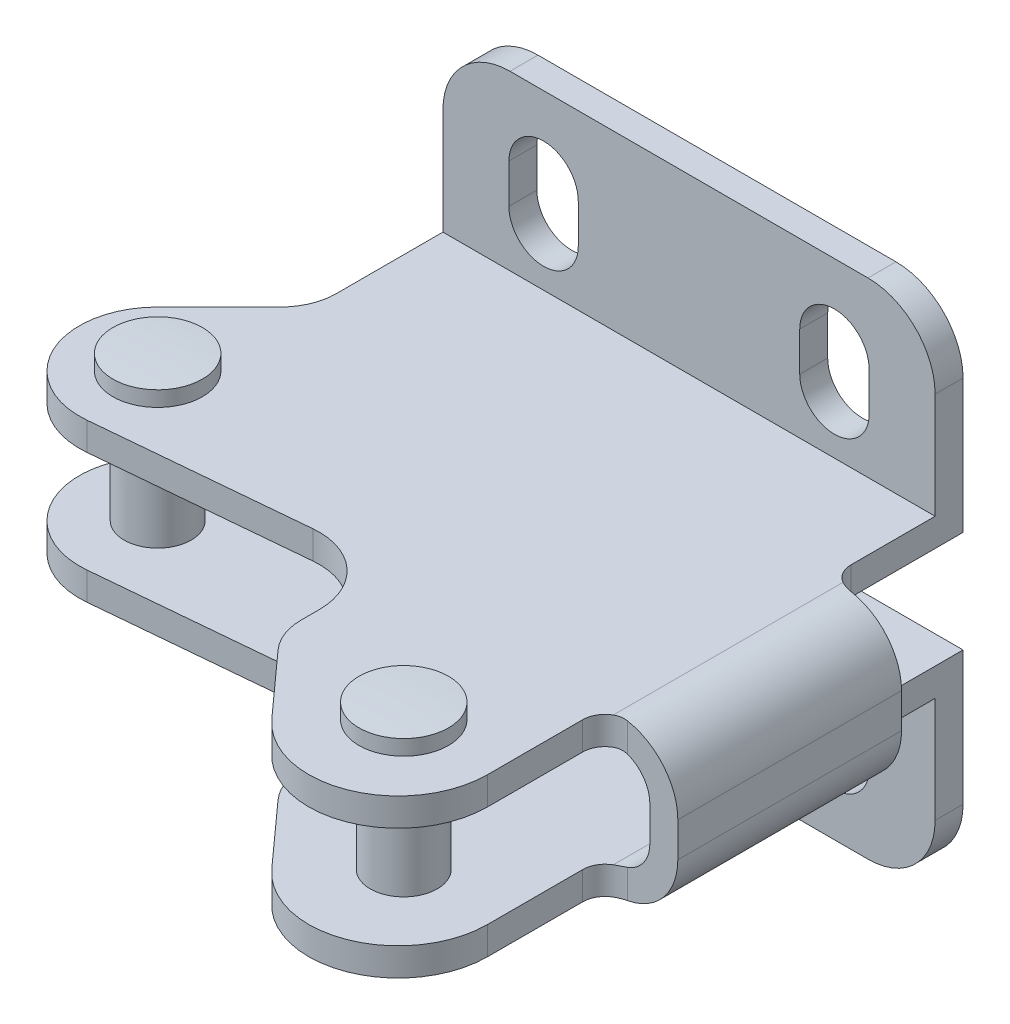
ISO-10303-21;
HEADER;
FILE_DESCRIPTION(('STEP AP214'),'2;1');
FILE_NAME('part.step','',(''),(''),'','','');
FILE_SCHEMA(('AUTOMOTIVE_DESIGN { 1 0 10303 214 1 1 1 1 }'));
ENDSEC;
DATA;
#1=APPLICATION_CONTEXT('core data for automotive mechanical design processes');
#2=APPLICATION_PROTOCOL_DEFINITION('international standard','automotive_design',2000,#1);
#3=PRODUCT_CONTEXT('',#1,'mechanical');
#4=PRODUCT('Part','Part','',(#3));
#5=PRODUCT_RELATED_PRODUCT_CATEGORY('part','',(#4));
#6=PRODUCT_DEFINITION_FORMATION('','',#4);
#7=PRODUCT_DEFINITION_CONTEXT('part definition',#1,'design');
#8=PRODUCT_DEFINITION('design','',#6,#7);
#9=PRODUCT_DEFINITION_SHAPE('','',#8);
#10=(LENGTH_UNIT() NAMED_UNIT(*) SI_UNIT(.MILLI.,.METRE.));
#11=(NAMED_UNIT(*) PLANE_ANGLE_UNIT() SI_UNIT($,.RADIAN.));
#12=(NAMED_UNIT(*) SI_UNIT($,.STERADIAN.) SOLID_ANGLE_UNIT());
#13=UNCERTAINTY_MEASURE_WITH_UNIT(LENGTH_MEASURE(1.E-05),#10,'distance_accuracy_value','');
#14=(GEOMETRIC_REPRESENTATION_CONTEXT(3) GLOBAL_UNCERTAINTY_ASSIGNED_CONTEXT((#13)) GLOBAL_UNIT_ASSIGNED_CONTEXT((#10,
#11,#12)) REPRESENTATION_CONTEXT('',''));
#15=CARTESIAN_POINT('',(0.,0.,0.));
#16=DIRECTION('',(0.,0.,1.));
#17=DIRECTION('',(1.,0.,0.));
#18=AXIS2_PLACEMENT_3D('',#15,#16,#17);
#19=CARTESIAN_POINT('',(-11.,10.1047005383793,26.));
#20=DIRECTION('',(0.,1.,0.));
#21=DIRECTION('',(1.,0.,0.));
#22=AXIS2_PLACEMENT_3D('',#19,#20,#21);
#23=CYLINDRICAL_SURFACE('',#22,3.);
#24=CARTESIAN_POINT('',(-11.,10.95,26.));
#25=DIRECTION('',(0.,1.,0.));
#26=DIRECTION('',(0.,0.,-1.));
#27=AXIS2_PLACEMENT_3D('',#24,#25,#26);
#28=CIRCLE('',#27,3.);
#29=CARTESIAN_POINT('',(-11.,10.95,23.));
#30=VERTEX_POINT('',#29);
#31=EDGE_CURVE('E9',#30,#30,#28,.F.);
#32=ORIENTED_EDGE('',*,*,#31,.F.);
#33=EDGE_LOOP('',(#32));
#34=FACE_BOUND('',#33,.T.);
#35=CARTESIAN_POINT('',(-11.,20.05,26.));
#36=DIRECTION('',(0.,-1.,0.));
#37=DIRECTION('',(0.,0.,1.));
#38=AXIS2_PLACEMENT_3D('',#35,#36,#37);
#39=CIRCLE('',#38,3.);
#40=CARTESIAN_POINT('',(-11.,20.05,29.));
#41=VERTEX_POINT('',#40);
#42=EDGE_CURVE('E24',#41,#41,#39,.F.);
#43=ORIENTED_EDGE('',*,*,#42,.F.);
#44=EDGE_LOOP('',(#43));
#45=FACE_BOUND('',#44,.T.);
#46=ADVANCED_FACE('F14',(#34,#45),#23,.T.);
#47=CARTESIAN_POINT('',(-11.,8.95,26.));
#48=DIRECTION('',(0.,-1.,0.));
#49=DIRECTION('',(-1.,0.,0.));
#50=AXIS2_PLACEMENT_3D('',#47,#48,#49);
#51=CONICAL_SURFACE('',#50,2.,1.04719755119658);
#52=CARTESIAN_POINT('',(-11.,10.1047005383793,26.));
#53=VERTEX_POINT('',#52);
#54=VERTEX_LOOP('',#53);
#55=FACE_BOUND('',#54,.T.);
#56=CARTESIAN_POINT('',(-11.,8.95,26.));
#57=DIRECTION('',(0.,1.,0.));
#58=DIRECTION('',(1.,0.,0.));
#59=AXIS2_PLACEMENT_3D('',#56,#57,#58);
#60=CIRCLE('',#59,2.);
#61=CARTESIAN_POINT('',(-9.,8.95,26.));
#62=VERTEX_POINT('',#61);
#63=EDGE_CURVE('E997',#62,#62,#60,.T.);
#64=ORIENTED_EDGE('',*,*,#63,.F.);
#65=EDGE_LOOP('',(#64));
#66=FACE_BOUND('',#65,.T.);
#67=ADVANCED_FACE('F814',(#55,#66),#51,.F.);
#68=CARTESIAN_POINT('',(-11.,10.1047005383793,26.));
#69=DIRECTION('',(0.,1.,0.));
#70=DIRECTION('',(1.,0.,0.));
#71=AXIS2_PLACEMENT_3D('',#68,#69,#70);
#72=CYLINDRICAL_SURFACE('',#71,2.);
#73=ORIENTED_EDGE('',*,*,#63,.T.);
#74=EDGE_LOOP('',(#73));
#75=FACE_BOUND('',#74,.T.);
#76=CARTESIAN_POINT('',(-11.,6.98334259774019,26.));
#77=DIRECTION('',(0.,1.,0.));
#78=DIRECTION('',(1.,0.,0.));
#79=AXIS2_PLACEMENT_3D('',#76,#77,#78);
#80=CIRCLE('',#79,2.);
#81=CARTESIAN_POINT('',(-11.,6.98334259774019,24.0000000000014));
#82=VERTEX_POINT('',#81);
#83=EDGE_CURVE('E1000',#82,#82,#80,.T.);
#84=ORIENTED_EDGE('',*,*,#83,.F.);
#85=EDGE_LOOP('',(#84));
#86=FACE_BOUND('',#85,.T.);
#87=ADVANCED_FACE('F822',(#75,#86),#72,.F.);
#88=CARTESIAN_POINT('',(-11.,66.9500000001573,26.0000000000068));
#89=DIRECTION('',(0.,1.,0.));
#90=DIRECTION('',(0.,0.,-1.));
#91=AXIS2_PLACEMENT_3D('',#88,#89,#90);
#92=SPHERICAL_SURFACE('',#91,60.0000000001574);
#93=CARTESIAN_POINT('',(-11.,7.0834818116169,26.));
#94=DIRECTION('',(0.,1.,0.));
#95=DIRECTION('',(1.,0.,0.));
#96=AXIS2_PLACEMENT_3D('',#93,#94,#95);
#97=CIRCLE('',#96,4.);
#98=CARTESIAN_POINT('',(-11.,7.08348181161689,22.0000000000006));
#99=VERTEX_POINT('',#98);
#100=EDGE_CURVE('E1039',#99,#99,#97,.T.);
#101=CARTESIAN_POINT('',(-11.,6.98334259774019,24.0000000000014));
#102=CARTESIAN_POINT('',(-11.,6.98403794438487,23.979151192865));
#103=CARTESIAN_POINT('',(-11.,6.98474416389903,23.9583027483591));
#104=CARTESIAN_POINT('',(-11.,6.98617834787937,23.9166066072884));
#105=CARTESIAN_POINT('',(-11.,6.98690631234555,23.8957589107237));
#106=CARTESIAN_POINT('',(-11.,6.98838398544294,23.8540642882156));
#107=CARTESIAN_POINT('',(-11.,6.98913369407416,23.8332173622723));
#108=CARTESIAN_POINT('',(-11.,6.99065485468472,23.7915243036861));
#109=CARTESIAN_POINT('',(-11.,6.99142630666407,23.7706781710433));
#110=CARTESIAN_POINT('',(-11.,6.99299095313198,23.7289867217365));
#111=CARTESIAN_POINT('',(-11.,6.99378414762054,23.7081414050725));
#112=CARTESIAN_POINT('',(-11.,6.99539227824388,23.6664516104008));
#113=CARTESIAN_POINT('',(-11.,6.99620721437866,23.6456071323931));
#114=CARTESIAN_POINT('',(-11.,6.99785882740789,23.6039190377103));
#115=CARTESIAN_POINT('',(-11.,6.99869550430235,23.5830754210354));
#116=CARTESIAN_POINT('',(-11.,7.00039059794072,23.5413890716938));
#117=CARTESIAN_POINT('',(-11.,7.00124901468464,23.5205463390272));
#118=CARTESIAN_POINT('',(-11.,7.00298758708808,23.4788617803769));
#119=CARTESIAN_POINT('',(-11.,7.00386774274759,23.4580199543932));
#120=CARTESIAN_POINT('',(-11.,7.00564979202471,23.4163372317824));
#121=CARTESIAN_POINT('',(-11.,7.00655168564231,23.3954963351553));
#122=CARTESIAN_POINT('',(-11.,7.00837720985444,23.3538154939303));
#123=CARTESIAN_POINT('',(-11.,7.00930084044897,23.3329755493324));
#124=CARTESIAN_POINT('',(-11.,7.01116983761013,23.2912966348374));
#125=CARTESIAN_POINT('',(-11.,7.01211520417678,23.2704576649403));
#126=CARTESIAN_POINT('',(-11.,7.01402767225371,23.2287807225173));
#127=CARTESIAN_POINT('',(-11.,7.01499477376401,23.2079427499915));
#128=CARTESIAN_POINT('',(-11.,7.01695071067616,23.1662678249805));
#129=CARTESIAN_POINT('',(-11.,7.01793954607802,23.1454308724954));
#130=CARTESIAN_POINT('',(-11.,7.01993894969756,23.1037580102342));
#131=CARTESIAN_POINT('',(-11.,7.02094951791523,23.0829221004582));
#132=CARTESIAN_POINT('',(-11.,7.022992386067,23.0412513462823));
#133=CARTESIAN_POINT('',(-11.,7.02402468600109,23.0204165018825));
#134=CARTESIAN_POINT('',(-11.,7.02611101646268,22.9787479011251));
#135=CARTESIAN_POINT('',(-11.,7.02716504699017,22.9579141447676));
#136=CARTESIAN_POINT('',(-11.,7.02929483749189,22.9162477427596));
#137=CARTESIAN_POINT('',(-11.,7.03037059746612,22.8954150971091));
#138=CARTESIAN_POINT('',(-11.,7.03254384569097,22.853750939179));
#139=CARTESIAN_POINT('',(-11.,7.03364133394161,22.8329194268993));
#140=CARTESIAN_POINT('',(-11.,7.03585803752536,22.7912575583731));
#141=CARTESIAN_POINT('',(-11.,7.03697725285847,22.7704272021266));
#142=CARTESIAN_POINT('',(-11.,7.03923740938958,22.7287676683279));
#143=CARTESIAN_POINT('',(-11.,7.04037835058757,22.7079384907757));
#144=CARTESIAN_POINT('',(-11.,7.04268195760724,22.6662813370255));
#145=CARTESIAN_POINT('',(-11.,7.0438446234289,22.6454533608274));
#146=CARTESIAN_POINT('',(-11.,7.04619167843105,22.6037986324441));
#147=CARTESIAN_POINT('',(-11.,7.04737606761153,22.5829718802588));
#148=CARTESIAN_POINT('',(-11.,7.04976656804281,22.5413196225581));
#149=CARTESIAN_POINT('',(-11.,7.05097267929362,22.5204941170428));
#150=CARTESIAN_POINT('',(-11.,7.05340662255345,22.478844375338));
#151=CARTESIAN_POINT('',(-11.,7.05463445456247,22.4580201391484));
#152=CARTESIAN_POINT('',(-11.,7.05711183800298,22.4163729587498));
#153=CARTESIAN_POINT('',(-11.,7.05836138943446,22.3955500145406));
#154=CARTESIAN_POINT('',(-11.,7.06088221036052,22.3539054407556));
#155=CARTESIAN_POINT('',(-11.,7.0621534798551,22.3330838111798));
#156=CARTESIAN_POINT('',(-11.,7.06471773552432,22.2914418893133));
#157=CARTESIAN_POINT('',(-11.,7.06601072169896,22.2706215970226));
#158=CARTESIAN_POINT('',(-11.,7.0686184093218,22.2289823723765));
#159=CARTESIAN_POINT('',(-11.,7.06993311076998,22.208163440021));
#160=CARTESIAN_POINT('',(-11.,7.07258422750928,22.1665269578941));
#161=CARTESIAN_POINT('',(-11.,7.07392064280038,22.1457094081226));
#162=CARTESIAN_POINT('',(-11.,7.07661518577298,22.1040757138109));
#163=CARTESIAN_POINT('',(-11.,7.07797331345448,22.0832595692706));
#164=CARTESIAN_POINT('',(-11.,7.08071127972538,22.0416287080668));
#165=CARTESIAN_POINT('',(-11.,7.08209111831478,22.0208139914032));
#166=CARTESIAN_POINT('',(-11.,7.08348181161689,22.0000000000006));
#167=B_SPLINE_CURVE_WITH_KNOTS('',3,(#101,#102,#103,#104,#105,#106,#107,#108,#109,#110,#111,
#112,#113,#114,#115,#116,#117,#118,#119,#120,#121,#122,#123,#124,#125,#126,#127,#128,#129,#130,
#131,#132,#133,#134,#135,#136,#137,#138,#139,#140,#141,#142,#143,#144,#145,#146,#147,#148,#149,
#150,#151,#152,#153,#154,#155,#156,#157,#158,#159,#160,#161,#162,#163,#164,#165,#166),
.UNSPECIFIED.,.F.,.F.,(4,2,2,2,2,2,2,2,2,2,2,2,2,2,2,2,2,2,2,2,2,2,2,2,2,2,2,2,2,2,2,2,4),(0.,
0.0625811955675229,0.125162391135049,0.187743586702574,0.250324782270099,0.312905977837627,
0.37548717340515,0.438068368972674,0.5006495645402,0.563230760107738,0.625811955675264,
0.688393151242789,0.750974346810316,0.813555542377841,0.876136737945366,0.938717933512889,
1.00129912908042,1.06388032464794,1.12646152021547,1.18904271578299,1.25162391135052,
1.31420510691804,1.37678630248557,1.43936749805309,1.50194869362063,1.56452988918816,
1.62711108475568,1.68969228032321,1.75227347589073,1.81485467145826,1.87743586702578,
1.94001706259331,2.00259825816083),.UNSPECIFIED.);
#168=EDGE_CURVE('BSEAM818',#82,#99,#167,.T.);
#169=ORIENTED_EDGE('',*,*,#83,.T.);
#170=ORIENTED_EDGE('',*,*,#100,.F.);
#171=ORIENTED_EDGE('',*,*,#168,.T.);
#172=ORIENTED_EDGE('',*,*,#168,.F.);
#173=EDGE_LOOP('',(#169,#171,#170,#172));
#174=FACE_BOUND('',#173,.T.);
#175=ADVANCED_FACE('F818',(#174),#92,.T.);
#176=CARTESIAN_POINT('',(-11.,10.1047005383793,26.));
#177=DIRECTION('',(0.,1.,0.));
#178=DIRECTION('',(1.,0.,0.));
#179=AXIS2_PLACEMENT_3D('',#176,#177,#178);
#180=CYLINDRICAL_SURFACE('',#179,4.);
#181=ORIENTED_EDGE('',*,*,#100,.T.);
#182=EDGE_LOOP('',(#181));
#183=FACE_BOUND('',#182,.T.);
#184=CARTESIAN_POINT('',(-11.,8.45,26.));
#185=DIRECTION('',(0.,1.,0.));
#186=DIRECTION('',(1.,0.,0.));
#187=AXIS2_PLACEMENT_3D('',#184,#185,#186);
#188=CIRCLE('',#187,4.);
#189=CARTESIAN_POINT('',(-7.,8.45,26.));
#190=VERTEX_POINT('',#189);
#191=EDGE_CURVE('E1036',#190,#190,#188,.T.);
#192=ORIENTED_EDGE('',*,*,#191,.F.);
#193=EDGE_LOOP('',(#192));
#194=FACE_BOUND('',#193,.T.);
#195=ADVANCED_FACE('F807',(#183,#194),#180,.T.);
#196=CARTESIAN_POINT('',(-11.,-35.9500000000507,26.0000000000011));
#197=DIRECTION('',(0.,1.,0.));
#198=DIRECTION('',(0.,0.,-1.));
#199=AXIS2_PLACEMENT_3D('',#196,#197,#198);
#200=SPHERICAL_SURFACE('',#199,60.0000000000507);
#201=CARTESIAN_POINT('',(-11.,23.9165181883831,26.));
#202=DIRECTION('',(0.,1.,0.));
#203=DIRECTION('',(1.,0.,0.));
#204=AXIS2_PLACEMENT_3D('',#201,#202,#203);
#205=CIRCLE('',#204,3.99999999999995);
#206=CARTESIAN_POINT('',(-7.00000000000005,23.9165181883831,26.));
#207=VERTEX_POINT('',#206);
#208=EDGE_CURVE('E1030',#207,#207,#205,.T.);
#209=ORIENTED_EDGE('',*,*,#208,.T.);
#210=EDGE_LOOP('',(#209));
#211=FACE_BOUND('',#210,.T.);
#212=ADVANCED_FACE('F804',(#211),#200,.T.);
#213=CARTESIAN_POINT('',(-11.,10.1047005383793,26.));
#214=DIRECTION('',(0.,1.,0.));
#215=DIRECTION('',(1.,0.,0.));
#216=AXIS2_PLACEMENT_3D('',#213,#214,#215);
#217=CYLINDRICAL_SURFACE('',#216,4.);
#218=CARTESIAN_POINT('',(-11.,22.55,26.));
#219=DIRECTION('',(0.,1.,0.));
#220=DIRECTION('',(1.,0.,0.));
#221=AXIS2_PLACEMENT_3D('',#218,#219,#220);
#222=CIRCLE('',#221,4.);
#223=CARTESIAN_POINT('',(-7.,22.55,26.));
#224=VERTEX_POINT('',#223);
#225=EDGE_CURVE('E1033',#224,#224,#222,.T.);
#226=ORIENTED_EDGE('',*,*,#225,.T.);
#227=EDGE_LOOP('',(#226));
#228=FACE_BOUND('',#227,.T.);
#229=ORIENTED_EDGE('',*,*,#208,.F.);
#230=EDGE_LOOP('',(#229));
#231=FACE_BOUND('',#230,.T.);
#232=ADVANCED_FACE('F802',(#228,#231),#217,.T.);
#233=CARTESIAN_POINT('',(27.,8.95,42.));
#234=DIRECTION('',(0.,-1.,0.));
#235=DIRECTION('',(-1.,0.,0.));
#236=AXIS2_PLACEMENT_3D('',#233,#234,#235);
#237=CONICAL_SURFACE('',#236,2.,1.04719755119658);
#238=CARTESIAN_POINT('',(27.,10.1047005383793,42.));
#239=VERTEX_POINT('',#238);
#240=VERTEX_LOOP('',#239);
#241=FACE_BOUND('',#240,.T.);
#242=CARTESIAN_POINT('',(27.,8.95,42.));
#243=DIRECTION('',(0.,1.,0.));
#244=DIRECTION('',(1.,0.,0.));
#245=AXIS2_PLACEMENT_3D('',#242,#243,#244);
#246=CIRCLE('',#245,2.);
#247=CARTESIAN_POINT('',(29.,8.95,42.));
#248=VERTEX_POINT('',#247);
#249=EDGE_CURVE('E994',#248,#248,#246,.T.);
#250=ORIENTED_EDGE('',*,*,#249,.F.);
#251=EDGE_LOOP('',(#250));
#252=FACE_BOUND('',#251,.T.);
#253=ADVANCED_FACE('F762',(#241,#252),#237,.F.);
#254=CARTESIAN_POINT('',(27.,10.1047005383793,42.));
#255=DIRECTION('',(0.,1.,0.));
#256=DIRECTION('',(1.,0.,0.));
#257=AXIS2_PLACEMENT_3D('',#254,#255,#256);
#258=CYLINDRICAL_SURFACE('',#257,2.);
#259=ORIENTED_EDGE('',*,*,#249,.T.);
#260=EDGE_LOOP('',(#259));
#261=FACE_BOUND('',#260,.T.);
#262=CARTESIAN_POINT('',(27.,6.98334259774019,42.));
#263=DIRECTION('',(0.,1.,0.));
#264=DIRECTION('',(1.,0.,0.));
#265=AXIS2_PLACEMENT_3D('',#262,#263,#264);
#266=CIRCLE('',#265,2.);
#267=CARTESIAN_POINT('',(27.,6.98334259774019,40.0000000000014));
#268=VERTEX_POINT('',#267);
#269=EDGE_CURVE('E1024',#268,#268,#266,.T.);
#270=ORIENTED_EDGE('',*,*,#269,.F.);
#271=EDGE_LOOP('',(#270));
#272=FACE_BOUND('',#271,.T.);
#273=ADVANCED_FACE('F752',(#261,#272),#258,.F.);
#274=CARTESIAN_POINT('',(27.,-35.9500000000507,42.0000000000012));
#275=DIRECTION('',(0.,1.,0.));
#276=DIRECTION('',(0.,0.,-1.));
#277=AXIS2_PLACEMENT_3D('',#274,#275,#276);
#278=SPHERICAL_SURFACE('',#277,60.0000000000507);
#279=CARTESIAN_POINT('',(27.,23.9165181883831,42.));
#280=DIRECTION('',(0.,1.,0.));
#281=DIRECTION('',(1.,0.,0.));
#282=AXIS2_PLACEMENT_3D('',#279,#280,#281);
#283=CIRCLE('',#282,3.99999999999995);
#284=CARTESIAN_POINT('',(30.9999999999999,23.9165181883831,42.));
#285=VERTEX_POINT('',#284);
#286=EDGE_CURVE('E1003',#285,#285,#283,.T.);
#287=ORIENTED_EDGE('',*,*,#286,.T.);
#288=EDGE_LOOP('',(#287));
#289=FACE_BOUND('',#288,.T.);
#290=ADVANCED_FACE('F740',(#289),#278,.T.);
#291=CARTESIAN_POINT('',(22.9,31.,2.5));
#292=DIRECTION('',(1.,0.,0.));
#293=DIRECTION('',(0.,1.,0.));
#294=AXIS2_PLACEMENT_3D('',#291,#292,#293);
#295=PLANE('',#294);
#296=DIRECTION('',(0.,-1.,0.));
#297=VECTOR('',#296,1.);
#298=CARTESIAN_POINT('',(22.9,31.,0.));
#299=LINE('',#298,#297);
#300=CARTESIAN_POINT('',(22.9,31.,0.));
#301=VERTEX_POINT('',#300);
#302=CARTESIAN_POINT('',(22.9,27.5,0.));
#303=VERTEX_POINT('',#302);
#304=EDGE_CURVE('E442',#301,#303,#299,.T.);
#305=ORIENTED_EDGE('',*,*,#304,.F.);
#306=DIRECTION('',(0.,0.,-1.));
#307=VECTOR('',#306,1.);
#308=CARTESIAN_POINT('',(22.9,31.,2.5));
#309=LINE('',#308,#307);
#310=CARTESIAN_POINT('',(22.9,31.,2.5));
#311=VERTEX_POINT('',#310);
#312=EDGE_CURVE('E460',#311,#301,#309,.T.);
#313=ORIENTED_EDGE('',*,*,#312,.F.);
#314=DIRECTION('',(0.,-1.,0.));
#315=VECTOR('',#314,1.);
#316=CARTESIAN_POINT('',(22.9,31.,2.5));
#317=LINE('',#316,#315);
#318=CARTESIAN_POINT('',(22.9,27.5,2.5));
#319=VERTEX_POINT('',#318);
#320=EDGE_CURVE('E456',#311,#319,#317,.T.);
#321=ORIENTED_EDGE('',*,*,#320,.T.);
#322=DIRECTION('',(0.,0.,-1.));
#323=VECTOR('',#322,1.);
#324=CARTESIAN_POINT('',(22.9,27.5,2.5));
#325=LINE('',#324,#323);
#326=EDGE_CURVE('E414',#319,#303,#325,.T.);
#327=ORIENTED_EDGE('',*,*,#326,.T.);
#328=EDGE_LOOP('',(#305,#313,#321,#327));
#329=FACE_BOUND('',#328,.T.);
#330=ADVANCED_FACE('F751',(#329),#295,.T.);
#331=CARTESIAN_POINT('',(26.,31.,2.5));
#332=DIRECTION('',(0.,0.,-1.));
#333=DIRECTION('',(0.,-1.,0.));
#334=AXIS2_PLACEMENT_3D('',#331,#332,#333);
#335=CYLINDRICAL_SURFACE('',#334,3.1);
#336=CARTESIAN_POINT('',(26.,31.,0.));
#337=DIRECTION('',(0.,0.,1.));
#338=DIRECTION('',(1.,0.,0.));
#339=AXIS2_PLACEMENT_3D('',#336,#337,#338);
#340=CIRCLE('',#339,3.1);
#341=CARTESIAN_POINT('',(29.1,31.,0.));
#342=VERTEX_POINT('',#341);
#343=EDGE_CURVE('E432',#342,#301,#340,.T.);
#344=ORIENTED_EDGE('',*,*,#343,.F.);
#345=DIRECTION('',(0.,0.,-1.));
#346=VECTOR('',#345,1.);
#347=CARTESIAN_POINT('',(29.1,31.,2.5));
#348=LINE('',#347,#346);
#349=CARTESIAN_POINT('',(29.1,31.,2.5));
#350=VERTEX_POINT('',#349);
#351=EDGE_CURVE('E427',#350,#342,#348,.T.);
#352=ORIENTED_EDGE('',*,*,#351,.F.);
#353=CARTESIAN_POINT('',(26.,31.,2.5));
#354=DIRECTION('',(0.,0.,1.));
#355=DIRECTION('',(1.,0.,0.));
#356=AXIS2_PLACEMENT_3D('',#353,#354,#355);
#357=CIRCLE('',#356,3.1);
#358=EDGE_CURVE('E450',#350,#311,#357,.T.);
#359=ORIENTED_EDGE('',*,*,#358,.T.);
#360=ORIENTED_EDGE('',*,*,#312,.T.);
#361=EDGE_LOOP('',(#344,#352,#359,#360));
#362=FACE_BOUND('',#361,.T.);
#363=ADVANCED_FACE('F759',(#362),#335,.F.);
#364=CARTESIAN_POINT('',(29.1,27.5,2.5));
#365=DIRECTION('',(-1.,0.,0.));
#366=DIRECTION('',(0.,-1.,0.));
#367=AXIS2_PLACEMENT_3D('',#364,#365,#366);
#368=PLANE('',#367);
#369=DIRECTION('',(0.,1.,0.));
#370=VECTOR('',#369,1.);
#371=CARTESIAN_POINT('',(29.1,27.5,0.));
#372=LINE('',#371,#370);
#373=CARTESIAN_POINT('',(29.1,27.5,0.));
#374=VERTEX_POINT('',#373);
#375=EDGE_CURVE('E421',#374,#342,#372,.T.);
#376=ORIENTED_EDGE('',*,*,#375,.F.);
#377=DIRECTION('',(0.,0.,-1.));
#378=VECTOR('',#377,1.);
#379=CARTESIAN_POINT('',(29.1,27.5,2.5));
#380=LINE('',#379,#378);
#381=CARTESIAN_POINT('',(29.1,27.5,2.5));
#382=VERTEX_POINT('',#381);
#383=EDGE_CURVE('E424',#382,#374,#380,.T.);
#384=ORIENTED_EDGE('',*,*,#383,.F.);
#385=DIRECTION('',(0.,1.,0.));
#386=VECTOR('',#385,1.);
#387=CARTESIAN_POINT('',(29.1,27.5,2.5));
#388=LINE('',#387,#386);
#389=EDGE_CURVE('E444',#382,#350,#388,.T.);
#390=ORIENTED_EDGE('',*,*,#389,.T.);
#391=ORIENTED_EDGE('',*,*,#351,.T.);
#392=EDGE_LOOP('',(#376,#384,#390,#391));
#393=FACE_BOUND('',#392,.T.);
#394=ADVANCED_FACE('F423',(#393),#368,.T.);
#395=CARTESIAN_POINT('',(26.,27.5,2.5));
#396=DIRECTION('',(0.,0.,-1.));
#397=DIRECTION('',(0.,-1.,0.));
#398=AXIS2_PLACEMENT_3D('',#395,#396,#397);
#399=CYLINDRICAL_SURFACE('',#398,3.1);
#400=CARTESIAN_POINT('',(26.,27.5,0.));
#401=DIRECTION('',(0.,0.,1.));
#402=DIRECTION('',(-1.,0.,0.));
#403=AXIS2_PLACEMENT_3D('',#400,#401,#402);
#404=CIRCLE('',#403,3.1);
#405=EDGE_CURVE('E435',#303,#374,#404,.T.);
#406=ORIENTED_EDGE('',*,*,#405,.F.);
#407=ORIENTED_EDGE('',*,*,#326,.F.);
#408=CARTESIAN_POINT('',(26.,27.5,2.5));
#409=DIRECTION('',(0.,0.,1.));
#410=DIRECTION('',(-1.,0.,0.));
#411=AXIS2_PLACEMENT_3D('',#408,#409,#410);
#412=CIRCLE('',#411,3.1);
#413=EDGE_CURVE('E438',#319,#382,#412,.T.);
#414=ORIENTED_EDGE('',*,*,#413,.T.);
#415=ORIENTED_EDGE('',*,*,#383,.T.);
#416=EDGE_LOOP('',(#406,#407,#414,#415));
#417=FACE_BOUND('',#416,.T.);
#418=ADVANCED_FACE('F434',(#417),#399,.F.);
#419=CARTESIAN_POINT('',(28.9999999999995,31.9999999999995,2.5));
#420=DIRECTION('',(0.,0.,-1.));
#421=DIRECTION('',(0.,-1.,0.));
#422=AXIS2_PLACEMENT_3D('',#419,#420,#421);
#423=CYLINDRICAL_SURFACE('',#422,6.00000000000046);
#424=CARTESIAN_POINT('',(28.9999999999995,31.9999999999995,0.));
#425=DIRECTION('',(0.,0.,1.));
#426=DIRECTION('',(-1.,0.,0.));
#427=AXIS2_PLACEMENT_3D('',#424,#425,#426);
#428=CIRCLE('',#427,6.00000000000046);
#429=CARTESIAN_POINT('',(35.,32.,0.));
#430=VERTEX_POINT('',#429);
#431=CARTESIAN_POINT('',(29.,38.,0.));
#432=VERTEX_POINT('',#431);
#433=EDGE_CURVE('E1205',#430,#432,#428,.T.);
#434=ORIENTED_EDGE('',*,*,#433,.T.);
#435=DIRECTION('',(0.,0.,-1.));
#436=VECTOR('',#435,1.);
#437=CARTESIAN_POINT('',(29.,38.,2.5));
#438=LINE('',#437,#436);
#439=CARTESIAN_POINT('',(29.,38.,2.5));
#440=VERTEX_POINT('',#439);
#441=EDGE_CURVE('E1262',#440,#432,#438,.T.);
#442=ORIENTED_EDGE('',*,*,#441,.F.);
#443=CARTESIAN_POINT('',(28.9999999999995,31.9999999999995,2.5));
#444=DIRECTION('',(0.,0.,1.));
#445=DIRECTION('',(-1.,0.,0.));
#446=AXIS2_PLACEMENT_3D('',#443,#444,#445);
#447=CIRCLE('',#446,6.00000000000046);
#448=CARTESIAN_POINT('',(35.,32.,2.5));
#449=VERTEX_POINT('',#448);
#450=EDGE_CURVE('E1226',#449,#440,#447,.T.);
#451=ORIENTED_EDGE('',*,*,#450,.F.);
#452=DIRECTION('',(0.,0.,-1.));
#453=VECTOR('',#452,1.);
#454=CARTESIAN_POINT('',(35.,32.,2.5));
#455=LINE('',#454,#453);
#456=EDGE_CURVE('E1265',#449,#430,#455,.T.);
#457=ORIENTED_EDGE('',*,*,#456,.T.);
#458=EDGE_LOOP('',(#434,#442,#451,#457));
#459=FACE_BOUND('',#458,.T.);
#460=ADVANCED_FACE('F712',(#459),#423,.T.);
#461=CARTESIAN_POINT('',(29.,38.,2.5));
#462=DIRECTION('',(0.,-1.,0.));
#463=DIRECTION('',(1.,0.,0.));
#464=AXIS2_PLACEMENT_3D('',#461,#462,#463);
#465=PLANE('',#464);
#466=DIRECTION('',(-1.,0.,0.));
#467=VECTOR('',#466,1.);
#468=CARTESIAN_POINT('',(29.,38.,0.));
#469=LINE('',#468,#467);
#470=CARTESIAN_POINT('',(-3.,38.,0.));
#471=VERTEX_POINT('',#470);
#472=EDGE_CURVE('E1208',#432,#471,#469,.T.);
#473=ORIENTED_EDGE('',*,*,#472,.T.);
#474=DIRECTION('',(0.,0.,-1.));
#475=VECTOR('',#474,1.);
#476=CARTESIAN_POINT('',(-3.,38.,2.5));
#477=LINE('',#476,#475);
#478=CARTESIAN_POINT('',(-3.,38.,2.5));
#479=VERTEX_POINT('',#478);
#480=EDGE_CURVE('E1259',#479,#471,#477,.T.);
#481=ORIENTED_EDGE('',*,*,#480,.F.);
#482=DIRECTION('',(-1.,0.,0.));
#483=VECTOR('',#482,1.);
#484=CARTESIAN_POINT('',(29.,38.,2.5));
#485=LINE('',#484,#483);
#486=EDGE_CURVE('E1228',#440,#479,#485,.T.);
#487=ORIENTED_EDGE('',*,*,#486,.F.);
#488=ORIENTED_EDGE('',*,*,#441,.T.);
#489=EDGE_LOOP('',(#473,#481,#487,#488));
#490=FACE_BOUND('',#489,.T.);
#491=ADVANCED_FACE('F708',(#490),#465,.F.);
#492=CARTESIAN_POINT('',(-3.1,31.,2.5));
#493=DIRECTION('',(1.,0.,0.));
#494=DIRECTION('',(0.,1.,0.));
#495=AXIS2_PLACEMENT_3D('',#492,#493,#494);
#496=PLANE('',#495);
#497=DIRECTION('',(0.,-1.,0.));
#498=VECTOR('',#497,1.);
#499=CARTESIAN_POINT('',(-3.1,31.,0.));
#500=LINE('',#499,#498);
#501=CARTESIAN_POINT('',(-3.1,31.,0.));
#502=VERTEX_POINT('',#501);
#503=CARTESIAN_POINT('',(-3.1,27.5,0.));
#504=VERTEX_POINT('',#503);
#505=EDGE_CURVE('E468',#502,#504,#500,.T.);
#506=ORIENTED_EDGE('',*,*,#505,.F.);
#507=DIRECTION('',(0.,0.,-1.));
#508=VECTOR('',#507,1.);
#509=CARTESIAN_POINT('',(-3.1,31.,2.5));
#510=LINE('',#509,#508);
#511=CARTESIAN_POINT('',(-3.1,31.,2.5));
#512=VERTEX_POINT('',#511);
#513=EDGE_CURVE('E492',#512,#502,#510,.T.);
#514=ORIENTED_EDGE('',*,*,#513,.F.);
#515=DIRECTION('',(0.,-1.,0.));
#516=VECTOR('',#515,1.);
#517=CARTESIAN_POINT('',(-3.1,31.,2.5));
#518=LINE('',#517,#516);
#519=CARTESIAN_POINT('',(-3.1,27.5,2.5));
#520=VERTEX_POINT('',#519);
#521=EDGE_CURVE('E481',#512,#520,#518,.T.);
#522=ORIENTED_EDGE('',*,*,#521,.T.);
#523=DIRECTION('',(0.,0.,-1.));
#524=VECTOR('',#523,1.);
#525=CARTESIAN_POINT('',(-3.1,27.5,2.5));
#526=LINE('',#525,#524);
#527=EDGE_CURVE('E490',#520,#504,#526,.T.);
#528=ORIENTED_EDGE('',*,*,#527,.T.);
#529=EDGE_LOOP('',(#506,#514,#522,#528));
#530=FACE_BOUND('',#529,.T.);
#531=ADVANCED_FACE('F711',(#530),#496,.T.);
#532=CARTESIAN_POINT('',(0.,31.,2.5));
#533=DIRECTION('',(0.,0.,-1.));
#534=DIRECTION('',(0.,-1.,0.));
#535=AXIS2_PLACEMENT_3D('',#532,#533,#534);
#536=CYLINDRICAL_SURFACE('',#535,3.1);
#537=CARTESIAN_POINT('',(0.,31.,0.));
#538=DIRECTION('',(0.,0.,1.));
#539=DIRECTION('',(1.,0.,0.));
#540=AXIS2_PLACEMENT_3D('',#537,#538,#539);
#541=CIRCLE('',#540,3.1);
#542=CARTESIAN_POINT('',(3.1,31.,0.));
#543=VERTEX_POINT('',#542);
#544=EDGE_CURVE('E464',#543,#502,#541,.T.);
#545=ORIENTED_EDGE('',*,*,#544,.F.);
#546=DIRECTION('',(0.,0.,-1.));
#547=VECTOR('',#546,1.);
#548=CARTESIAN_POINT('',(3.1,31.,2.5));
#549=LINE('',#548,#547);
#550=CARTESIAN_POINT('',(3.1,31.,2.5));
#551=VERTEX_POINT('',#550);
#552=EDGE_CURVE('E494',#551,#543,#549,.T.);
#553=ORIENTED_EDGE('',*,*,#552,.F.);
#554=CARTESIAN_POINT('',(0.,31.,2.5));
#555=DIRECTION('',(0.,0.,1.));
#556=DIRECTION('',(1.,0.,0.));
#557=AXIS2_PLACEMENT_3D('',#554,#555,#556);
#558=CIRCLE('',#557,3.1);
#559=EDGE_CURVE('E479',#551,#512,#558,.T.);
#560=ORIENTED_EDGE('',*,*,#559,.T.);
#561=ORIENTED_EDGE('',*,*,#513,.T.);
#562=EDGE_LOOP('',(#545,#553,#560,#561));
#563=FACE_BOUND('',#562,.T.);
#564=ADVANCED_FACE('F848',(#563),#536,.F.);
#565=CARTESIAN_POINT('',(3.1,27.5,2.5));
#566=DIRECTION('',(-1.,0.,0.));
#567=DIRECTION('',(0.,-1.,0.));
#568=AXIS2_PLACEMENT_3D('',#565,#566,#567);
#569=PLANE('',#568);
#570=DIRECTION('',(0.,1.,0.));
#571=VECTOR('',#570,1.);
#572=CARTESIAN_POINT('',(3.1,27.5,0.));
#573=LINE('',#572,#571);
#574=CARTESIAN_POINT('',(3.1,27.5,0.));
#575=VERTEX_POINT('',#574);
#576=EDGE_CURVE('E463',#575,#543,#573,.T.);
#577=ORIENTED_EDGE('',*,*,#576,.F.);
#578=DIRECTION('',(0.,0.,-1.));
#579=VECTOR('',#578,1.);
#580=CARTESIAN_POINT('',(3.1,27.5,2.5));
#581=LINE('',#580,#579);
#582=CARTESIAN_POINT('',(3.1,27.5,2.5));
#583=VERTEX_POINT('',#582);
#584=EDGE_CURVE('E486',#583,#575,#581,.T.);
#585=ORIENTED_EDGE('',*,*,#584,.F.);
#586=DIRECTION('',(0.,1.,0.));
#587=VECTOR('',#586,1.);
#588=CARTESIAN_POINT('',(3.1,27.5,2.5));
#589=LINE('',#588,#587);
#590=EDGE_CURVE('E476',#583,#551,#589,.T.);
#591=ORIENTED_EDGE('',*,*,#590,.T.);
#592=ORIENTED_EDGE('',*,*,#552,.T.);
#593=EDGE_LOOP('',(#577,#585,#591,#592));
#594=FACE_BOUND('',#593,.T.);
#595=ADVANCED_FACE('F844',(#594),#569,.T.);
#596=CARTESIAN_POINT('',(0.,27.5,2.5));
#597=DIRECTION('',(0.,0.,-1.));
#598=DIRECTION('',(0.,-1.,0.));
#599=AXIS2_PLACEMENT_3D('',#596,#597,#598);
#600=CYLINDRICAL_SURFACE('',#599,3.1);
#601=CARTESIAN_POINT('',(0.,27.5,0.));
#602=DIRECTION('',(0.,0.,1.));
#603=DIRECTION('',(-1.,0.,0.));
#604=AXIS2_PLACEMENT_3D('',#601,#602,#603);
#605=CIRCLE('',#604,3.1);
#606=EDGE_CURVE('E472',#504,#575,#605,.T.);
#607=ORIENTED_EDGE('',*,*,#606,.F.);
#608=ORIENTED_EDGE('',*,*,#527,.F.);
#609=CARTESIAN_POINT('',(0.,27.5,2.5));
#610=DIRECTION('',(0.,0.,1.));
#611=DIRECTION('',(-1.,0.,0.));
#612=AXIS2_PLACEMENT_3D('',#609,#610,#611);
#613=CIRCLE('',#612,3.1);
#614=EDGE_CURVE('E484',#520,#583,#613,.T.);
#615=ORIENTED_EDGE('',*,*,#614,.T.);
#616=ORIENTED_EDGE('',*,*,#584,.T.);
#617=EDGE_LOOP('',(#607,#608,#615,#616));
#618=FACE_BOUND('',#617,.T.);
#619=ADVANCED_FACE('F706',(#618),#600,.F.);
#620=CARTESIAN_POINT('',(-2.99999999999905,31.9999999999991,2.5));
#621=DIRECTION('',(0.,0.,-1.));
#622=DIRECTION('',(0.,-1.,0.));
#623=AXIS2_PLACEMENT_3D('',#620,#621,#622);
#624=CYLINDRICAL_SURFACE('',#623,6.00000000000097);
#625=CARTESIAN_POINT('',(-2.99999999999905,31.9999999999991,0.));
#626=DIRECTION('',(0.,0.,1.));
#627=DIRECTION('',(1.,0.,0.));
#628=AXIS2_PLACEMENT_3D('',#625,#626,#627);
#629=CIRCLE('',#628,6.00000000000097);
#630=CARTESIAN_POINT('',(-9.,31.9999999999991,0.));
#631=VERTEX_POINT('',#630);
#632=EDGE_CURVE('E1211',#471,#631,#629,.T.);
#633=ORIENTED_EDGE('',*,*,#632,.T.);
#634=DIRECTION('',(0.,0.,-1.));
#635=VECTOR('',#634,1.);
#636=CARTESIAN_POINT('',(-9.,31.9999999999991,2.5));
#637=LINE('',#636,#635);
#638=CARTESIAN_POINT('',(-9.,31.9999999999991,2.5));
#639=VERTEX_POINT('',#638);
#640=EDGE_CURVE('E1256',#639,#631,#637,.T.);
#641=ORIENTED_EDGE('',*,*,#640,.F.);
#642=CARTESIAN_POINT('',(-2.99999999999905,31.9999999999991,2.5));
#643=DIRECTION('',(0.,0.,1.));
#644=DIRECTION('',(1.,0.,0.));
#645=AXIS2_PLACEMENT_3D('',#642,#643,#644);
#646=CIRCLE('',#645,6.00000000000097);
#647=EDGE_CURVE('E1231',#479,#639,#646,.T.);
#648=ORIENTED_EDGE('',*,*,#647,.F.);
#649=ORIENTED_EDGE('',*,*,#480,.T.);
#650=EDGE_LOOP('',(#633,#641,#648,#649));
#651=FACE_BOUND('',#650,.T.);
#652=ADVANCED_FACE('F679',(#651),#624,.T.);
#653=CARTESIAN_POINT('',(39.,13.95,50.5));
#654=DIRECTION('',(-1.,0.,0.));
#655=DIRECTION('',(0.,-1.,0.));
#656=AXIS2_PLACEMENT_3D('',#653,#654,#655);
#657=PLANE('',#656);
#658=DIRECTION('',(0.,0.,-1.));
#659=VECTOR('',#658,1.);
#660=CARTESIAN_POINT('',(39.,13.95,50.5));
#661=LINE('',#660,#659);
#662=CARTESIAN_POINT('',(39.,13.95,32.));
#663=VERTEX_POINT('',#662);
#664=CARTESIAN_POINT('',(39.,13.95,12.));
#665=VERTEX_POINT('',#664);
#666=EDGE_CURVE('E1113',#663,#665,#661,.T.);
#667=ORIENTED_EDGE('',*,*,#666,.F.);
#668=DIRECTION('',(0.,-1.,0.));
#669=VECTOR('',#668,1.);
#670=CARTESIAN_POINT('',(39.,8.45,32.));
#671=LINE('',#670,#669);
#672=CARTESIAN_POINT('',(39.,17.05,32.));
#673=VERTEX_POINT('',#672);
#674=EDGE_CURVE('E983',#673,#663,#671,.T.);
#675=ORIENTED_EDGE('',*,*,#674,.F.);
#676=DIRECTION('',(0.,0.,-1.));
#677=VECTOR('',#676,1.);
#678=CARTESIAN_POINT('',(39.,17.05,50.5));
#679=LINE('',#678,#677);
#680=CARTESIAN_POINT('',(39.,17.05,12.));
#681=VERTEX_POINT('',#680);
#682=EDGE_CURVE('E1116',#673,#681,#679,.T.);
#683=ORIENTED_EDGE('',*,*,#682,.T.);
#684=DIRECTION('',(0.,1.,0.));
#685=VECTOR('',#684,1.);
#686=CARTESIAN_POINT('',(39.,8.45,12.));
#687=LINE('',#686,#685);
#688=EDGE_CURVE('E1126',#665,#681,#687,.T.);
#689=ORIENTED_EDGE('',*,*,#688,.F.);
#690=EDGE_LOOP('',(#667,#675,#683,#689));
#691=FACE_BOUND('',#690,.T.);
#692=ADVANCED_FACE('F673',(#691),#657,.T.);
#693=CARTESIAN_POINT('',(26.,3.5,2.5));
#694=DIRECTION('',(0.,0.,-1.));
#695=DIRECTION('',(0.,-1.,0.));
#696=AXIS2_PLACEMENT_3D('',#693,#694,#695);
#697=CYLINDRICAL_SURFACE('',#696,3.1);
#698=CARTESIAN_POINT('',(26.,3.5,0.));
#699=DIRECTION('',(0.,0.,1.));
#700=DIRECTION('',(1.,0.,0.));
#701=AXIS2_PLACEMENT_3D('',#698,#699,#700);
#702=CIRCLE('',#701,3.1);
#703=CARTESIAN_POINT('',(29.1,3.5,0.));
#704=VERTEX_POINT('',#703);
#705=CARTESIAN_POINT('',(22.9,3.5,0.));
#706=VERTEX_POINT('',#705);
#707=EDGE_CURVE('E502',#704,#706,#702,.T.);
#708=ORIENTED_EDGE('',*,*,#707,.F.);
#709=DIRECTION('',(0.,0.,-1.));
#710=VECTOR('',#709,1.);
#711=CARTESIAN_POINT('',(29.1,3.5,2.5));
#712=LINE('',#711,#710);
#713=CARTESIAN_POINT('',(29.1,3.5,2.5));
#714=VERTEX_POINT('',#713);
#715=EDGE_CURVE('E527',#714,#704,#712,.T.);
#716=ORIENTED_EDGE('',*,*,#715,.F.);
#717=CARTESIAN_POINT('',(26.,3.5,2.5));
#718=DIRECTION('',(0.,0.,1.));
#719=DIRECTION('',(1.,0.,0.));
#720=AXIS2_PLACEMENT_3D('',#717,#718,#719);
#721=CIRCLE('',#720,3.1);
#722=CARTESIAN_POINT('',(22.9,3.5,2.5));
#723=VERTEX_POINT('',#722);
#724=EDGE_CURVE('E516',#714,#723,#721,.T.);
#725=ORIENTED_EDGE('',*,*,#724,.T.);
#726=DIRECTION('',(0.,0.,-1.));
#727=VECTOR('',#726,1.);
#728=CARTESIAN_POINT('',(22.9,3.5,2.5));
#729=LINE('',#728,#727);
#730=EDGE_CURVE('E525',#723,#706,#729,.T.);
#731=ORIENTED_EDGE('',*,*,#730,.T.);
#732=EDGE_LOOP('',(#708,#716,#725,#731));
#733=FACE_BOUND('',#732,.T.);
#734=ADVANCED_FACE('F678',(#733),#697,.F.);
#735=CARTESIAN_POINT('',(22.9,3.5,2.5));
#736=DIRECTION('',(1.,0.,0.));
#737=DIRECTION('',(0.,1.,0.));
#738=AXIS2_PLACEMENT_3D('',#735,#736,#737);
#739=PLANE('',#738);
#740=DIRECTION('',(0.,-1.,0.));
#741=VECTOR('',#740,1.);
#742=CARTESIAN_POINT('',(22.9,3.5,0.));
#743=LINE('',#742,#741);
#744=CARTESIAN_POINT('',(22.9,0.,0.));
#745=VERTEX_POINT('',#744);
#746=EDGE_CURVE('E506',#706,#745,#743,.T.);
#747=ORIENTED_EDGE('',*,*,#746,.F.);
#748=ORIENTED_EDGE('',*,*,#730,.F.);
#749=DIRECTION('',(0.,-1.,0.));
#750=VECTOR('',#749,1.);
#751=CARTESIAN_POINT('',(22.9,3.5,2.5));
#752=LINE('',#751,#750);
#753=CARTESIAN_POINT('',(22.9,0.,2.5));
#754=VERTEX_POINT('',#753);
#755=EDGE_CURVE('E519',#723,#754,#752,.T.);
#756=ORIENTED_EDGE('',*,*,#755,.T.);
#757=DIRECTION('',(0.,0.,-1.));
#758=VECTOR('',#757,1.);
#759=CARTESIAN_POINT('',(22.9,0.,2.5));
#760=LINE('',#759,#758);
#761=EDGE_CURVE('E521',#754,#745,#760,.T.);
#762=ORIENTED_EDGE('',*,*,#761,.T.);
#763=EDGE_LOOP('',(#747,#748,#756,#762));
#764=FACE_BOUND('',#763,.T.);
#765=ADVANCED_FACE('F856',(#764),#739,.T.);
#766=CARTESIAN_POINT('',(26.,0.,2.5));
#767=DIRECTION('',(0.,0.,-1.));
#768=DIRECTION('',(0.,-1.,0.));
#769=AXIS2_PLACEMENT_3D('',#766,#767,#768);
#770=CYLINDRICAL_SURFACE('',#769,3.1);
#771=CARTESIAN_POINT('',(26.,0.,0.));
#772=DIRECTION('',(0.,0.,1.));
#773=DIRECTION('',(-1.,0.,0.));
#774=AXIS2_PLACEMENT_3D('',#771,#772,#773);
#775=CIRCLE('',#774,3.1);
#776=CARTESIAN_POINT('',(29.1,0.,0.));
#777=VERTEX_POINT('',#776);
#778=EDGE_CURVE('E497',#745,#777,#775,.T.);
#779=ORIENTED_EDGE('',*,*,#778,.F.);
#780=ORIENTED_EDGE('',*,*,#761,.F.);
#781=CARTESIAN_POINT('',(26.,0.,2.5));
#782=DIRECTION('',(0.,0.,1.));
#783=DIRECTION('',(-1.,0.,0.));
#784=AXIS2_PLACEMENT_3D('',#781,#782,#783);
#785=CIRCLE('',#784,3.1);
#786=CARTESIAN_POINT('',(29.1,0.,2.5));
#787=VERTEX_POINT('',#786);
#788=EDGE_CURVE('E510',#754,#787,#785,.T.);
#789=ORIENTED_EDGE('',*,*,#788,.T.);
#790=DIRECTION('',(0.,0.,-1.));
#791=VECTOR('',#790,1.);
#792=CARTESIAN_POINT('',(29.1,0.,2.5));
#793=LINE('',#792,#791);
#794=EDGE_CURVE('E529',#787,#777,#793,.T.);
#795=ORIENTED_EDGE('',*,*,#794,.T.);
#796=EDGE_LOOP('',(#779,#780,#789,#795));
#797=FACE_BOUND('',#796,.T.);
#798=ADVANCED_FACE('F859',(#797),#770,.F.);
#799=CARTESIAN_POINT('',(29.1,0.,2.5));
#800=DIRECTION('',(-1.,0.,0.));
#801=DIRECTION('',(0.,-1.,0.));
#802=AXIS2_PLACEMENT_3D('',#799,#800,#801);
#803=PLANE('',#802);
#804=DIRECTION('',(0.,1.,0.));
#805=VECTOR('',#804,1.);
#806=CARTESIAN_POINT('',(29.1,0.,0.));
#807=LINE('',#806,#805);
#808=EDGE_CURVE('E498',#777,#704,#807,.T.);
#809=ORIENTED_EDGE('',*,*,#808,.F.);
#810=ORIENTED_EDGE('',*,*,#794,.F.);
#811=DIRECTION('',(0.,1.,0.));
#812=VECTOR('',#811,1.);
#813=CARTESIAN_POINT('',(29.1,0.,2.5));
#814=LINE('',#813,#812);
#815=EDGE_CURVE('E514',#787,#714,#814,.T.);
#816=ORIENTED_EDGE('',*,*,#815,.T.);
#817=ORIENTED_EDGE('',*,*,#715,.T.);
#818=EDGE_LOOP('',(#809,#810,#816,#817));
#819=FACE_BOUND('',#818,.T.);
#820=ADVANCED_FACE('F692',(#819),#803,.T.);
#821=CARTESIAN_POINT('',(28.9999999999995,-0.99999999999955,2.5));
#822=DIRECTION('',(0.,0.,-1.));
#823=DIRECTION('',(0.,-1.,0.));
#824=AXIS2_PLACEMENT_3D('',#821,#822,#823);
#825=CYLINDRICAL_SURFACE('',#824,6.00000000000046);
#826=CARTESIAN_POINT('',(28.9999999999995,-0.99999999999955,0.));
#827=DIRECTION('',(0.,0.,1.));
#828=DIRECTION('',(-1.,0.,0.));
#829=AXIS2_PLACEMENT_3D('',#826,#827,#828);
#830=CIRCLE('',#829,6.00000000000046);
#831=CARTESIAN_POINT('',(29.,-7.,0.));
#832=VERTEX_POINT('',#831);
#833=CARTESIAN_POINT('',(35.,-1.,0.));
#834=VERTEX_POINT('',#833);
#835=EDGE_CURVE('E1221',#832,#834,#830,.T.);
#836=ORIENTED_EDGE('',*,*,#835,.T.);
#837=DIRECTION('',(0.,0.,-1.));
#838=VECTOR('',#837,1.);
#839=CARTESIAN_POINT('',(35.,-1.,2.5));
#840=LINE('',#839,#838);
#841=CARTESIAN_POINT('',(35.,-1.,2.5));
#842=VERTEX_POINT('',#841);
#843=EDGE_CURVE('E1243',#842,#834,#840,.T.);
#844=ORIENTED_EDGE('',*,*,#843,.F.);
#845=CARTESIAN_POINT('',(28.9999999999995,-0.99999999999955,2.5));
#846=DIRECTION('',(0.,0.,1.));
#847=DIRECTION('',(-1.,0.,0.));
#848=AXIS2_PLACEMENT_3D('',#845,#846,#847);
#849=CIRCLE('',#848,6.00000000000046);
#850=CARTESIAN_POINT('',(29.,-7.,2.5));
#851=VERTEX_POINT('',#850);
#852=EDGE_CURVE('E1241',#851,#842,#849,.T.);
#853=ORIENTED_EDGE('',*,*,#852,.F.);
#854=DIRECTION('',(0.,0.,-1.));
#855=VECTOR('',#854,1.);
#856=CARTESIAN_POINT('',(29.,-7.,2.5));
#857=LINE('',#856,#855);
#858=EDGE_CURVE('E1247',#851,#832,#857,.T.);
#859=ORIENTED_EDGE('',*,*,#858,.T.);
#860=EDGE_LOOP('',(#836,#844,#853,#859));
#861=FACE_BOUND('',#860,.T.);
#862=ADVANCED_FACE('F681',(#861),#825,.T.);
#863=CARTESIAN_POINT('',(-3.,-7.,2.5));
#864=DIRECTION('',(0.,1.,0.));
#865=DIRECTION('',(-1.,0.,0.));
#866=AXIS2_PLACEMENT_3D('',#863,#864,#865);
#867=PLANE('',#866);
#868=DIRECTION('',(1.,0.,0.));
#869=VECTOR('',#868,1.);
#870=CARTESIAN_POINT('',(-3.,-7.,0.));
#871=LINE('',#870,#869);
#872=CARTESIAN_POINT('',(-3.,-7.,0.));
#873=VERTEX_POINT('',#872);
#874=EDGE_CURVE('E1218',#873,#832,#871,.T.);
#875=ORIENTED_EDGE('',*,*,#874,.T.);
#876=ORIENTED_EDGE('',*,*,#858,.F.);
#877=DIRECTION('',(1.,0.,0.));
#878=VECTOR('',#877,1.);
#879=CARTESIAN_POINT('',(-3.,-7.,2.5));
#880=LINE('',#879,#878);
#881=CARTESIAN_POINT('',(-3.,-7.,2.5));
#882=VERTEX_POINT('',#881);
#883=EDGE_CURVE('E1239',#882,#851,#880,.T.);
#884=ORIENTED_EDGE('',*,*,#883,.F.);
#885=DIRECTION('',(0.,0.,-1.));
#886=VECTOR('',#885,1.);
#887=CARTESIAN_POINT('',(-3.,-7.,2.5));
#888=LINE('',#887,#886);
#889=EDGE_CURVE('E1250',#882,#873,#888,.T.);
#890=ORIENTED_EDGE('',*,*,#889,.T.);
#891=EDGE_LOOP('',(#875,#876,#884,#890));
#892=FACE_BOUND('',#891,.T.);
#893=ADVANCED_FACE('F691',(#892),#867,.F.);
#894=CARTESIAN_POINT('',(0.,3.5,2.5));
#895=DIRECTION('',(0.,0.,-1.));
#896=DIRECTION('',(0.,-1.,0.));
#897=AXIS2_PLACEMENT_3D('',#894,#895,#896);
#898=CYLINDRICAL_SURFACE('',#897,3.1);
#899=CARTESIAN_POINT('',(0.,3.5,0.));
#900=DIRECTION('',(0.,0.,1.));
#901=DIRECTION('',(1.,0.,0.));
#902=AXIS2_PLACEMENT_3D('',#899,#900,#901);
#903=CIRCLE('',#902,3.1);
#904=CARTESIAN_POINT('',(3.1,3.5,0.));
#905=VERTEX_POINT('',#904);
#906=CARTESIAN_POINT('',(-3.1,3.5,0.));
#907=VERTEX_POINT('',#906);
#908=EDGE_CURVE('E537',#905,#907,#903,.T.);
#909=ORIENTED_EDGE('',*,*,#908,.F.);
#910=DIRECTION('',(0.,0.,-1.));
#911=VECTOR('',#910,1.);
#912=CARTESIAN_POINT('',(3.1,3.5,2.5));
#913=LINE('',#912,#911);
#914=CARTESIAN_POINT('',(3.1,3.5,2.5));
#915=VERTEX_POINT('',#914);
#916=EDGE_CURVE('E562',#915,#905,#913,.T.);
#917=ORIENTED_EDGE('',*,*,#916,.F.);
#918=CARTESIAN_POINT('',(0.,3.5,2.5));
#919=DIRECTION('',(0.,0.,1.));
#920=DIRECTION('',(1.,0.,0.));
#921=AXIS2_PLACEMENT_3D('',#918,#919,#920);
#922=CIRCLE('',#921,3.1);
#923=CARTESIAN_POINT('',(-3.1,3.5,2.5));
#924=VERTEX_POINT('',#923);
#925=EDGE_CURVE('E551',#915,#924,#922,.T.);
#926=ORIENTED_EDGE('',*,*,#925,.T.);
#927=DIRECTION('',(0.,0.,-1.));
#928=VECTOR('',#927,1.);
#929=CARTESIAN_POINT('',(-3.1,3.5,2.5));
#930=LINE('',#929,#928);
#931=EDGE_CURVE('E560',#924,#907,#930,.T.);
#932=ORIENTED_EDGE('',*,*,#931,.T.);
#933=EDGE_LOOP('',(#909,#917,#926,#932));
#934=FACE_BOUND('',#933,.T.);
#935=ADVANCED_FACE('F696',(#934),#898,.F.);
#936=CARTESIAN_POINT('',(-3.1,3.5,2.5));
#937=DIRECTION('',(1.,0.,0.));
#938=DIRECTION('',(0.,1.,0.));
#939=AXIS2_PLACEMENT_3D('',#936,#937,#938);
#940=PLANE('',#939);
#941=DIRECTION('',(0.,-1.,0.));
#942=VECTOR('',#941,1.);
#943=CARTESIAN_POINT('',(-3.1,3.5,0.));
#944=LINE('',#943,#942);
#945=CARTESIAN_POINT('',(-3.1,0.,0.));
#946=VERTEX_POINT('',#945);
#947=EDGE_CURVE('E541',#907,#946,#944,.T.);
#948=ORIENTED_EDGE('',*,*,#947,.F.);
#949=ORIENTED_EDGE('',*,*,#931,.F.);
#950=DIRECTION('',(0.,-1.,0.));
#951=VECTOR('',#950,1.);
#952=CARTESIAN_POINT('',(-3.1,3.5,2.5));
#953=LINE('',#952,#951);
#954=CARTESIAN_POINT('',(-3.1,0.,2.5));
#955=VERTEX_POINT('',#954);
#956=EDGE_CURVE('E554',#924,#955,#953,.T.);
#957=ORIENTED_EDGE('',*,*,#956,.T.);
#958=DIRECTION('',(0.,0.,-1.));
#959=VECTOR('',#958,1.);
#960=CARTESIAN_POINT('',(-3.1,0.,2.5));
#961=LINE('',#960,#959);
#962=EDGE_CURVE('E556',#955,#946,#961,.T.);
#963=ORIENTED_EDGE('',*,*,#962,.T.);
#964=EDGE_LOOP('',(#948,#949,#957,#963));
#965=FACE_BOUND('',#964,.T.);
#966=ADVANCED_FACE('F870',(#965),#940,.T.);
#967=CARTESIAN_POINT('',(0.,0.,2.5));
#968=DIRECTION('',(0.,0.,-1.));
#969=DIRECTION('',(0.,-1.,0.));
#970=AXIS2_PLACEMENT_3D('',#967,#968,#969);
#971=CYLINDRICAL_SURFACE('',#970,3.1);
#972=CARTESIAN_POINT('',(0.,0.,0.));
#973=DIRECTION('',(0.,0.,1.));
#974=DIRECTION('',(-1.,0.,0.));
#975=AXIS2_PLACEMENT_3D('',#972,#973,#974);
#976=CIRCLE('',#975,3.1);
#977=CARTESIAN_POINT('',(3.1,0.,0.));
#978=VERTEX_POINT('',#977);
#979=EDGE_CURVE('E532',#946,#978,#976,.T.);
#980=ORIENTED_EDGE('',*,*,#979,.F.);
#981=ORIENTED_EDGE('',*,*,#962,.F.);
#982=CARTESIAN_POINT('',(0.,0.,2.5));
#983=DIRECTION('',(0.,0.,1.));
#984=DIRECTION('',(-1.,0.,0.));
#985=AXIS2_PLACEMENT_3D('',#982,#983,#984);
#986=CIRCLE('',#985,3.1);
#987=CARTESIAN_POINT('',(3.1,0.,2.5));
#988=VERTEX_POINT('',#987);
#989=EDGE_CURVE('E545',#955,#988,#986,.T.);
#990=ORIENTED_EDGE('',*,*,#989,.T.);
#991=DIRECTION('',(0.,0.,-1.));
#992=VECTOR('',#991,1.);
#993=CARTESIAN_POINT('',(3.1,0.,2.5));
#994=LINE('',#993,#992);
#995=EDGE_CURVE('E564',#988,#978,#994,.T.);
#996=ORIENTED_EDGE('',*,*,#995,.T.);
#997=EDGE_LOOP('',(#980,#981,#990,#996));
#998=FACE_BOUND('',#997,.T.);
#999=ADVANCED_FACE('F873',(#998),#971,.F.);
#1000=CARTESIAN_POINT('',(3.1,0.,2.5));
#1001=DIRECTION('',(-1.,0.,0.));
#1002=DIRECTION('',(0.,-1.,0.));
#1003=AXIS2_PLACEMENT_3D('',#1000,#1001,#1002);
#1004=PLANE('',#1003);
#1005=DIRECTION('',(0.,1.,0.));
#1006=VECTOR('',#1005,1.);
#1007=CARTESIAN_POINT('',(3.1,0.,0.));
#1008=LINE('',#1007,#1006);
#1009=EDGE_CURVE('E533',#978,#905,#1008,.T.);
#1010=ORIENTED_EDGE('',*,*,#1009,.F.);
#1011=ORIENTED_EDGE('',*,*,#995,.F.);
#1012=DIRECTION('',(0.,1.,0.));
#1013=VECTOR('',#1012,1.);
#1014=CARTESIAN_POINT('',(3.1,0.,2.5));
#1015=LINE('',#1014,#1013);
#1016=EDGE_CURVE('E549',#988,#915,#1015,.T.);
#1017=ORIENTED_EDGE('',*,*,#1016,.T.);
#1018=ORIENTED_EDGE('',*,*,#916,.T.);
#1019=EDGE_LOOP('',(#1010,#1011,#1017,#1018));
#1020=FACE_BOUND('',#1019,.T.);
#1021=ADVANCED_FACE('F702',(#1020),#1004,.T.);
#1022=CARTESIAN_POINT('',(-2.99999999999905,-0.99999999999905,2.5));
#1023=DIRECTION('',(0.,0.,-1.));
#1024=DIRECTION('',(0.,-1.,0.));
#1025=AXIS2_PLACEMENT_3D('',#1022,#1023,#1024);
#1026=CYLINDRICAL_SURFACE('',#1025,6.00000000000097);
#1027=CARTESIAN_POINT('',(-2.99999999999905,-0.99999999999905,0.));
#1028=DIRECTION('',(0.,0.,1.));
#1029=DIRECTION('',(-1.,0.,0.));
#1030=AXIS2_PLACEMENT_3D('',#1027,#1028,#1029);
#1031=CIRCLE('',#1030,6.00000000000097);
#1032=CARTESIAN_POINT('',(-9.,-1.,0.));
#1033=VERTEX_POINT('',#1032);
#1034=EDGE_CURVE('E1215',#1033,#873,#1031,.T.);
#1035=ORIENTED_EDGE('',*,*,#1034,.T.);
#1036=ORIENTED_EDGE('',*,*,#889,.F.);
#1037=CARTESIAN_POINT('',(-2.99999999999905,-0.99999999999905,2.5));
#1038=DIRECTION('',(0.,0.,1.));
#1039=DIRECTION('',(-1.,0.,0.));
#1040=AXIS2_PLACEMENT_3D('',#1037,#1038,#1039);
#1041=CIRCLE('',#1040,6.00000000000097);
#1042=CARTESIAN_POINT('',(-9.,-1.,2.5));
#1043=VERTEX_POINT('',#1042);
#1044=EDGE_CURVE('E1237',#1043,#882,#1041,.T.);
#1045=ORIENTED_EDGE('',*,*,#1044,.F.);
#1046=DIRECTION('',(0.,0.,-1.));
#1047=VECTOR('',#1046,1.);
#1048=CARTESIAN_POINT('',(-9.,-1.,2.5));
#1049=LINE('',#1048,#1047);
#1050=EDGE_CURVE('E1253',#1043,#1033,#1049,.T.);
#1051=ORIENTED_EDGE('',*,*,#1050,.T.);
#1052=EDGE_LOOP('',(#1035,#1036,#1045,#1051));
#1053=FACE_BOUND('',#1052,.T.);
#1054=ADVANCED_FACE('F698',(#1053),#1026,.T.);
#1055=CARTESIAN_POINT('',(37.,8.45,32.));
#1056=DIRECTION('',(0.,0.,1.));
#1057=DIRECTION('',(0.,1.,0.));
#1058=AXIS2_PLACEMENT_3D('',#1055,#1056,#1057);
#1059=PLANE('',#1058);
#1060=DIRECTION('',(0.,1.,0.));
#1061=VECTOR('',#1060,1.);
#1062=CARTESIAN_POINT('',(41.5,8.45,32.));
#1063=LINE('',#1062,#1061);
#1064=CARTESIAN_POINT('',(41.5,13.95,32.));
#1065=VERTEX_POINT('',#1064);
#1066=CARTESIAN_POINT('',(41.5,17.05,32.));
#1067=VERTEX_POINT('',#1066);
#1068=EDGE_CURVE('E899',#1065,#1067,#1063,.T.);
#1069=ORIENTED_EDGE('',*,*,#1068,.T.);
#1070=CARTESIAN_POINT('',(36.,17.05,32.));
#1071=DIRECTION('',(0.,0.,1.));
#1072=DIRECTION('',(0.,1.,0.));
#1073=AXIS2_PLACEMENT_3D('',#1070,#1071,#1072);
#1074=CIRCLE('',#1073,5.5);
#1075=CARTESIAN_POINT('',(37.,22.458326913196,32.));
#1076=VERTEX_POINT('',#1075);
#1077=EDGE_CURVE('E577',#1067,#1076,#1074,.T.);
#1078=ORIENTED_EDGE('',*,*,#1077,.T.);
#1079=DIRECTION('',(0.,1.,0.));
#1080=VECTOR('',#1079,1.);
#1081=CARTESIAN_POINT('',(37.,8.45,32.));
#1082=LINE('',#1081,#1080);
#1083=CARTESIAN_POINT('',(37.,19.8784271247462,32.));
#1084=VERTEX_POINT('',#1083);
#1085=EDGE_CURVE('E906',#1084,#1076,#1082,.T.);
#1086=ORIENTED_EDGE('',*,*,#1085,.F.);
#1087=CARTESIAN_POINT('',(36.,17.05,32.));
#1088=DIRECTION('',(0.,0.,1.));
#1089=DIRECTION('',(0.,1.,0.));
#1090=AXIS2_PLACEMENT_3D('',#1087,#1088,#1089);
#1091=CIRCLE('',#1090,3.00000000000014);
#1092=EDGE_CURVE('E986',#1084,#673,#1091,.F.);
#1093=ORIENTED_EDGE('',*,*,#1092,.T.);
#1094=ORIENTED_EDGE('',*,*,#674,.T.);
#1095=CARTESIAN_POINT('',(36.,13.9500000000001,32.));
#1096=DIRECTION('',(0.,0.,1.));
#1097=DIRECTION('',(0.,1.,0.));
#1098=AXIS2_PLACEMENT_3D('',#1095,#1096,#1097);
#1099=CIRCLE('',#1098,3.00000000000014);
#1100=CARTESIAN_POINT('',(37.,11.1215728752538,32.));
#1101=VERTEX_POINT('',#1100);
#1102=EDGE_CURVE('E981',#663,#1101,#1099,.F.);
#1103=ORIENTED_EDGE('',*,*,#1102,.T.);
#1104=CARTESIAN_POINT('',(37.,8.54167308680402,32.));
#1105=VERTEX_POINT('',#1104);
#1106=EDGE_CURVE('E901',#1105,#1101,#1082,.T.);
#1107=ORIENTED_EDGE('',*,*,#1106,.F.);
#1108=CARTESIAN_POINT('',(36.,13.95,32.));
#1109=DIRECTION('',(0.,0.,1.));
#1110=DIRECTION('',(0.,1.,0.));
#1111=AXIS2_PLACEMENT_3D('',#1108,#1109,#1110);
#1112=CIRCLE('',#1111,5.5);
#1113=EDGE_CURVE('E891',#1105,#1065,#1112,.T.);
#1114=ORIENTED_EDGE('',*,*,#1113,.T.);
#1115=EDGE_LOOP('',(#1069,#1078,#1086,#1093,#1094,#1103,#1107,#1114));
#1116=FACE_BOUND('',#1115,.T.);
#1117=ADVANCED_FACE('F701',(#1116),#1059,.T.);
#1118=CARTESIAN_POINT('',(41.5,8.45,32.));
#1119=DIRECTION('',(1.,0.,0.));
#1120=DIRECTION('',(0.,1.,0.));
#1121=AXIS2_PLACEMENT_3D('',#1118,#1119,#1120);
#1122=PLANE('',#1121);
#1123=DIRECTION('',(0.,0.,-1.));
#1124=VECTOR('',#1123,1.);
#1125=CARTESIAN_POINT('',(41.5,17.05,50.5));
#1126=LINE('',#1125,#1124);
#1127=CARTESIAN_POINT('',(41.5,17.05,12.));
#1128=VERTEX_POINT('',#1127);
#1129=EDGE_CURVE('E572',#1067,#1128,#1126,.T.);
#1130=ORIENTED_EDGE('',*,*,#1129,.F.);
#1131=ORIENTED_EDGE('',*,*,#1068,.F.);
#1132=DIRECTION('',(0.,0.,-1.));
#1133=VECTOR('',#1132,1.);
#1134=CARTESIAN_POINT('',(41.5,13.95,50.5));
#1135=LINE('',#1134,#1133);
#1136=CARTESIAN_POINT('',(41.5,13.95,12.));
#1137=VERTEX_POINT('',#1136);
#1138=EDGE_CURVE('E569',#1065,#1137,#1135,.T.);
#1139=ORIENTED_EDGE('',*,*,#1138,.T.);
#1140=DIRECTION('',(0.,1.,0.));
#1141=VECTOR('',#1140,1.);
#1142=CARTESIAN_POINT('',(41.5,8.45,12.));
#1143=LINE('',#1142,#1141);
#1144=EDGE_CURVE('E977',#1137,#1128,#1143,.T.);
#1145=ORIENTED_EDGE('',*,*,#1144,.T.);
#1146=EDGE_LOOP('',(#1130,#1131,#1139,#1145));
#1147=FACE_BOUND('',#1146,.T.);
#1148=ADVANCED_FACE('F16',(#1147),#1122,.T.);
#1149=CARTESIAN_POINT('',(41.5,8.45,12.));
#1150=DIRECTION('',(0.,0.,-1.));
#1151=DIRECTION('',(0.,-1.,0.));
#1152=AXIS2_PLACEMENT_3D('',#1149,#1150,#1151);
#1153=PLANE('',#1152);
#1154=DIRECTION('',(0.,1.,0.));
#1155=VECTOR('',#1154,1.);
#1156=CARTESIAN_POINT('',(37.,8.45,12.));
#1157=LINE('',#1156,#1155);
#1158=CARTESIAN_POINT('',(37.,19.8784271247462,12.));
#1159=VERTEX_POINT('',#1158);
#1160=CARTESIAN_POINT('',(37.,22.458326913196,12.));
#1161=VERTEX_POINT('',#1160);
#1162=EDGE_CURVE('E974',#1159,#1161,#1157,.T.);
#1163=ORIENTED_EDGE('',*,*,#1162,.T.);
#1164=CARTESIAN_POINT('',(36.,17.05,12.));
#1165=DIRECTION('',(0.,0.,-1.));
#1166=DIRECTION('',(0.,-1.,0.));
#1167=AXIS2_PLACEMENT_3D('',#1164,#1165,#1166);
#1168=CIRCLE('',#1167,5.5);
#1169=EDGE_CURVE('E903',#1161,#1128,#1168,.T.);
#1170=ORIENTED_EDGE('',*,*,#1169,.T.);
#1171=ORIENTED_EDGE('',*,*,#1144,.F.);
#1172=CARTESIAN_POINT('',(36.,13.95,12.));
#1173=DIRECTION('',(0.,0.,-1.));
#1174=DIRECTION('',(0.,-1.,0.));
#1175=AXIS2_PLACEMENT_3D('',#1172,#1173,#1174);
#1176=CIRCLE('',#1175,5.5);
#1177=CARTESIAN_POINT('',(37.,8.54167308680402,12.));
#1178=VERTEX_POINT('',#1177);
#1179=EDGE_CURVE('E894',#1137,#1178,#1176,.T.);
#1180=ORIENTED_EDGE('',*,*,#1179,.T.);
#1181=CARTESIAN_POINT('',(37.,11.1215728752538,12.));
#1182=VERTEX_POINT('',#1181);
#1183=EDGE_CURVE('E975',#1178,#1182,#1157,.T.);
#1184=ORIENTED_EDGE('',*,*,#1183,.T.);
#1185=CARTESIAN_POINT('',(36.,13.9500000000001,12.));
#1186=DIRECTION('',(0.,0.,-1.));
#1187=DIRECTION('',(0.,-1.,0.));
#1188=AXIS2_PLACEMENT_3D('',#1185,#1186,#1187);
#1189=CIRCLE('',#1188,3.00000000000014);
#1190=EDGE_CURVE('E635',#1182,#665,#1189,.F.);
#1191=ORIENTED_EDGE('',*,*,#1190,.T.);
#1192=ORIENTED_EDGE('',*,*,#688,.T.);
#1193=CARTESIAN_POINT('',(36.,17.05,12.));
#1194=DIRECTION('',(0.,0.,-1.));
#1195=DIRECTION('',(0.,-1.,0.));
#1196=AXIS2_PLACEMENT_3D('',#1193,#1194,#1195);
#1197=CIRCLE('',#1196,3.00000000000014);
#1198=EDGE_CURVE('E660',#681,#1159,#1197,.F.);
#1199=ORIENTED_EDGE('',*,*,#1198,.T.);
#1200=EDGE_LOOP('',(#1163,#1170,#1171,#1180,#1184,#1191,#1192,#1199));
#1201=FACE_BOUND('',#1200,.T.);
#1202=ADVANCED_FACE('F645',(#1201),#1153,.T.);
#1203=CARTESIAN_POINT('',(27.,66.9500000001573,42.0000000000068));
#1204=DIRECTION('',(0.,1.,0.));
#1205=DIRECTION('',(0.,0.,-1.));
#1206=AXIS2_PLACEMENT_3D('',#1203,#1204,#1205);
#1207=SPHERICAL_SURFACE('',#1206,60.0000000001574);
#1208=CARTESIAN_POINT('',(27.,7.0834818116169,42.));
#1209=DIRECTION('',(0.,1.,0.));
#1210=DIRECTION('',(1.,0.,0.));
#1211=AXIS2_PLACEMENT_3D('',#1208,#1209,#1210);
#1212=CIRCLE('',#1211,4.);
#1213=CARTESIAN_POINT('',(27.,7.08348181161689,38.0000000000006));
#1214=VERTEX_POINT('',#1213);
#1215=EDGE_CURVE('E1022',#1214,#1214,#1212,.T.);
#1216=CARTESIAN_POINT('',(27.,6.98334259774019,40.0000000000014));
#1217=CARTESIAN_POINT('',(27.,6.98403794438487,39.979151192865));
#1218=CARTESIAN_POINT('',(27.,6.98474416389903,39.9583027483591));
#1219=CARTESIAN_POINT('',(27.,6.98617834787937,39.9166066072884));
#1220=CARTESIAN_POINT('',(27.,6.98690631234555,39.8957589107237));
#1221=CARTESIAN_POINT('',(27.,6.98838398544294,39.8540642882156));
#1222=CARTESIAN_POINT('',(27.,6.98913369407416,39.8332173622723));
#1223=CARTESIAN_POINT('',(27.,6.99065485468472,39.7915243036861));
#1224=CARTESIAN_POINT('',(27.,6.99142630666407,39.7706781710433));
#1225=CARTESIAN_POINT('',(27.,6.99299095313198,39.7289867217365));
#1226=CARTESIAN_POINT('',(27.,6.99378414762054,39.7081414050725));
#1227=CARTESIAN_POINT('',(27.,6.99539227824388,39.6664516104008));
#1228=CARTESIAN_POINT('',(27.,6.99620721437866,39.6456071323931));
#1229=CARTESIAN_POINT('',(27.,6.99785882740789,39.6039190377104));
#1230=CARTESIAN_POINT('',(27.,6.99869550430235,39.5830754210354));
#1231=CARTESIAN_POINT('',(27.,7.00039059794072,39.5413890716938));
#1232=CARTESIAN_POINT('',(27.,7.00124901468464,39.5205463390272));
#1233=CARTESIAN_POINT('',(27.,7.00298758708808,39.4788617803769));
#1234=CARTESIAN_POINT('',(27.,7.00386774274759,39.4580199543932));
#1235=CARTESIAN_POINT('',(27.,7.00564979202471,39.4163372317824));
#1236=CARTESIAN_POINT('',(27.,7.00655168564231,39.3954963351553));
#1237=CARTESIAN_POINT('',(27.,7.00837720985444,39.3538154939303));
#1238=CARTESIAN_POINT('',(27.,7.00930084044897,39.3329755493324));
#1239=CARTESIAN_POINT('',(27.,7.01116983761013,39.2912966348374));
#1240=CARTESIAN_POINT('',(27.,7.01211520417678,39.2704576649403));
#1241=CARTESIAN_POINT('',(27.,7.01402767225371,39.2287807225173));
#1242=CARTESIAN_POINT('',(27.,7.01499477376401,39.2079427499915));
#1243=CARTESIAN_POINT('',(27.,7.01695071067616,39.1662678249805));
#1244=CARTESIAN_POINT('',(27.,7.01793954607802,39.1454308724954));
#1245=CARTESIAN_POINT('',(27.,7.01993894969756,39.1037580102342));
#1246=CARTESIAN_POINT('',(27.,7.02094951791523,39.0829221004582));
#1247=CARTESIAN_POINT('',(27.,7.022992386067,39.0412513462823));
#1248=CARTESIAN_POINT('',(27.,7.02402468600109,39.0204165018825));
#1249=CARTESIAN_POINT('',(27.,7.02611101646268,38.9787479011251));
#1250=CARTESIAN_POINT('',(27.,7.02716504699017,38.9579141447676));
#1251=CARTESIAN_POINT('',(27.,7.02929483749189,38.9162477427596));
#1252=CARTESIAN_POINT('',(27.,7.03037059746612,38.8954150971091));
#1253=CARTESIAN_POINT('',(27.,7.03254384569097,38.853750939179));
#1254=CARTESIAN_POINT('',(27.,7.03364133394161,38.8329194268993));
#1255=CARTESIAN_POINT('',(27.,7.03585803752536,38.7912575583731));
#1256=CARTESIAN_POINT('',(27.,7.03697725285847,38.7704272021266));
#1257=CARTESIAN_POINT('',(27.,7.03923740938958,38.7287676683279));
#1258=CARTESIAN_POINT('',(27.,7.04037835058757,38.7079384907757));
#1259=CARTESIAN_POINT('',(27.,7.04268195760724,38.6662813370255));
#1260=CARTESIAN_POINT('',(27.,7.0438446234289,38.6454533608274));
#1261=CARTESIAN_POINT('',(27.,7.04619167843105,38.6037986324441));
#1262=CARTESIAN_POINT('',(27.,7.04737606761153,38.5829718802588));
#1263=CARTESIAN_POINT('',(27.,7.04976656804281,38.5413196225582));
#1264=CARTESIAN_POINT('',(27.,7.05097267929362,38.5204941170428));
#1265=CARTESIAN_POINT('',(27.,7.05340662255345,38.478844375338));
#1266=CARTESIAN_POINT('',(27.,7.05463445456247,38.4580201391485));
#1267=CARTESIAN_POINT('',(27.,7.05711183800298,38.4163729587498));
#1268=CARTESIAN_POINT('',(27.,7.05836138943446,38.3955500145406));
#1269=CARTESIAN_POINT('',(27.,7.06088221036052,38.3539054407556));
#1270=CARTESIAN_POINT('',(27.,7.0621534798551,38.3330838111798));
#1271=CARTESIAN_POINT('',(27.,7.06471773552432,38.2914418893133));
#1272=CARTESIAN_POINT('',(27.,7.06601072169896,38.2706215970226));
#1273=CARTESIAN_POINT('',(27.,7.0686184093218,38.2289823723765));
#1274=CARTESIAN_POINT('',(27.,7.06993311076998,38.208163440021));
#1275=CARTESIAN_POINT('',(27.,7.07258422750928,38.1665269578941));
#1276=CARTESIAN_POINT('',(27.,7.07392064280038,38.1457094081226));
#1277=CARTESIAN_POINT('',(27.,7.07661518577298,38.1040757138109));
#1278=CARTESIAN_POINT('',(27.,7.07797331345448,38.0832595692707));
#1279=CARTESIAN_POINT('',(27.,7.08071127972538,38.0416287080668));
#1280=CARTESIAN_POINT('',(27.,7.08209111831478,38.0208139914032));
#1281=CARTESIAN_POINT('',(27.,7.08348181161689,38.0000000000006));
#1282=B_SPLINE_CURVE_WITH_KNOTS('',3,(#1216,#1217,#1218,#1219,#1220,#1221,#1222,#1223,#1224,
#1225,#1226,#1227,#1228,#1229,#1230,#1231,#1232,#1233,#1234,#1235,#1236,#1237,#1238,#1239,#1240,
#1241,#1242,#1243,#1244,#1245,#1246,#1247,#1248,#1249,#1250,#1251,#1252,#1253,#1254,#1255,#1256,
#1257,#1258,#1259,#1260,#1261,#1262,#1263,#1264,#1265,#1266,#1267,#1268,#1269,#1270,#1271,#1272,
#1273,#1274,#1275,#1276,#1277,#1278,#1279,#1280,#1281),.UNSPECIFIED.,.F.,.F.,(4,2,2,2,2,2,2,2,2,
2,2,2,2,2,2,2,2,2,2,2,2,2,2,2,2,2,2,2,2,2,2,2,4),(0.,0.0625811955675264,0.125162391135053,
0.187743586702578,0.250324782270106,0.312905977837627,0.37548717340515,0.438068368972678,
0.500649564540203,0.563230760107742,0.625811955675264,0.688393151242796,0.750974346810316,
0.813555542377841,0.876136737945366,0.938717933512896,1.00129912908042,1.06388032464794,
1.12646152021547,1.189042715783,1.25162391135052,1.31420510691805,1.37678630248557,
1.43936749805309,1.50194869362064,1.56452988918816,1.62711108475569,1.68969228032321,
1.75227347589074,1.81485467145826,1.87743586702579,1.94001706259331,2.00259825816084),.UNSPECIFIED.);
#1283=EDGE_CURVE('BSEAM765',#268,#1214,#1282,.T.);
#1284=ORIENTED_EDGE('',*,*,#269,.T.);
#1285=ORIENTED_EDGE('',*,*,#1215,.F.);
#1286=ORIENTED_EDGE('',*,*,#1283,.T.);
#1287=ORIENTED_EDGE('',*,*,#1283,.F.);
#1288=EDGE_LOOP('',(#1284,#1286,#1285,#1287));
#1289=FACE_BOUND('',#1288,.T.);
#1290=ADVANCED_FACE('F765',(#1289),#1207,.T.);
#1291=CARTESIAN_POINT('',(28.9999999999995,31.9999999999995,2.5));
#1292=DIRECTION('',(0.,0.,1.));
#1293=DIRECTION('',(0.,1.,0.));
#1294=AXIS2_PLACEMENT_3D('',#1291,#1292,#1293);
#1295=PLANE('',#1294);
#1296=ORIENTED_EDGE('',*,*,#559,.F.);
#1297=ORIENTED_EDGE('',*,*,#590,.F.);
#1298=ORIENTED_EDGE('',*,*,#614,.F.);
#1299=ORIENTED_EDGE('',*,*,#521,.F.);
#1300=EDGE_LOOP('',(#1296,#1297,#1298,#1299));
#1301=FACE_BOUND('',#1300,.T.);
#1302=DIRECTION('',(-1.,0.,0.));
#1303=VECTOR('',#1302,1.);
#1304=CARTESIAN_POINT('',(37.,22.55,2.5));
#1305=LINE('',#1304,#1303);
#1306=CARTESIAN_POINT('',(35.,22.55,2.5));
#1307=VERTEX_POINT('',#1306);
#1308=CARTESIAN_POINT('',(-9.,22.55,2.5));
#1309=VERTEX_POINT('',#1308);
#1310=EDGE_CURVE('E979',#1307,#1309,#1305,.T.);
#1311=ORIENTED_EDGE('',*,*,#1310,.F.);
#1312=DIRECTION('',(0.,1.,0.));
#1313=VECTOR('',#1312,1.);
#1314=CARTESIAN_POINT('',(35.,-1.,2.5));
#1315=LINE('',#1314,#1313);
#1316=EDGE_CURVE('E1225',#1307,#449,#1315,.T.);
#1317=ORIENTED_EDGE('',*,*,#1316,.T.);
#1318=ORIENTED_EDGE('',*,*,#450,.T.);
#1319=ORIENTED_EDGE('',*,*,#486,.T.);
#1320=ORIENTED_EDGE('',*,*,#647,.T.);
#1321=DIRECTION('',(0.,-1.,0.));
#1322=VECTOR('',#1321,1.);
#1323=CARTESIAN_POINT('',(-9.,32.,2.5));
#1324=LINE('',#1323,#1322);
#1325=EDGE_CURVE('E1234',#639,#1309,#1324,.T.);
#1326=ORIENTED_EDGE('',*,*,#1325,.T.);
#1327=EDGE_LOOP('',(#1311,#1317,#1318,#1319,#1320,#1326));
#1328=FACE_BOUND('',#1327,.T.);
#1329=ORIENTED_EDGE('',*,*,#358,.F.);
#1330=ORIENTED_EDGE('',*,*,#389,.F.);
#1331=ORIENTED_EDGE('',*,*,#413,.F.);
#1332=ORIENTED_EDGE('',*,*,#320,.F.);
#1333=EDGE_LOOP('',(#1329,#1330,#1331,#1332));
#1334=FACE_BOUND('',#1333,.T.);
#1335=ADVANCED_FACE('F606',(#1301,#1328,#1334),#1295,.T.);
#1336=CARTESIAN_POINT('',(36.,17.05,50.5));
#1337=DIRECTION('',(0.,0.,-1.));
#1338=DIRECTION('',(0.,-1.,0.));
#1339=AXIS2_PLACEMENT_3D('',#1336,#1337,#1338);
#1340=CYLINDRICAL_SURFACE('',#1339,5.5);
#1341=CARTESIAN_POINT('',(36.,22.55,11.7320508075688));
#1342=CARTESIAN_POINT('',(36.0469586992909,22.550005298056,11.7591709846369));
#1343=CARTESIAN_POINT('',(36.0950296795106,22.5493988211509,11.7843698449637));
#1344=CARTESIAN_POINT('',(36.1930414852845,22.5468284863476,11.8307787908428));
#1345=CARTESIAN_POINT('',(36.2429828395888,22.5448642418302,11.8519877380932));
#1346=CARTESIAN_POINT('',(36.3431963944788,22.5395062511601,11.8898182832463));
#1347=CARTESIAN_POINT('',(36.393435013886,22.5361461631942,11.9065335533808));
#1348=CARTESIAN_POINT('',(36.4949427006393,22.527921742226,11.9359000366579));
#1349=CARTESIAN_POINT('',(36.5462113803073,22.5230579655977,11.9485527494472));
#1350=CARTESIAN_POINT('',(36.6637711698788,22.5102005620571,11.9726821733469));
#1351=CARTESIAN_POINT('',(36.730279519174,22.5017128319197,11.9828560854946));
#1352=CARTESIAN_POINT('',(36.8646076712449,22.482052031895,11.9965767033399));
#1353=CARTESIAN_POINT('',(36.9324322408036,22.4708408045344,12.0000223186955));
#1354=CARTESIAN_POINT('',(37.,22.458326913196,12.));
#1355=B_SPLINE_CURVE_WITH_KNOTS('',3,(#1341,#1342,#1343,#1344,#1345,#1346,#1347,#1348,#1349,
#1350,#1351,#1352,#1353,#1354),.UNSPECIFIED.,.F.,.F.,(4,2,2,2,2,2,4),(0.,0.162637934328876,
0.325322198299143,0.484292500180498,0.643204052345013,0.846254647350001,1.05233322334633),.UNSPECIFIED.);
#1356=CARTESIAN_POINT('',(36.,22.55,11.7320508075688));
#1357=VERTEX_POINT('',#1356);
#1358=EDGE_CURVE('E589',#1357,#1161,#1355,.T.);
#1359=ORIENTED_EDGE('',*,*,#1358,.F.);
#1360=DIRECTION('',(0.,0.,-1.));
#1361=VECTOR('',#1360,1.);
#1362=CARTESIAN_POINT('',(36.,22.55,50.5));
#1363=LINE('',#1362,#1361);
#1364=CARTESIAN_POINT('',(36.,22.55,32.2679491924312));
#1365=VERTEX_POINT('',#1364);
#1366=EDGE_CURVE('E574',#1365,#1357,#1363,.T.);
#1367=ORIENTED_EDGE('',*,*,#1366,.F.);
#1368=CARTESIAN_POINT('',(37.,22.458326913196,32.));
#1369=CARTESIAN_POINT('',(36.9466782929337,22.468193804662,31.9999922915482));
#1370=CARTESIAN_POINT('',(36.89320472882,22.4772580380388,32.0021322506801));
#1371=CARTESIAN_POINT('',(36.7863389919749,22.4937645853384,32.0107249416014));
#1372=CARTESIAN_POINT('',(36.7329468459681,22.5012064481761,32.0171788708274));
#1373=CARTESIAN_POINT('',(36.6278717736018,22.5142950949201,32.0342202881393));
#1374=CARTESIAN_POINT('',(36.5761776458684,22.5199789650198,32.0447100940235));
#1375=CARTESIAN_POINT('',(36.4736648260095,22.5298078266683,32.0697782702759));
#1376=CARTESIAN_POINT('',(36.4228458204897,22.5339533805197,32.0843551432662));
#1377=CARTESIAN_POINT('',(36.3084782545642,22.5417176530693,32.1221406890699));
#1378=CARTESIAN_POINT('',(36.2453146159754,22.5448702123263,32.1466223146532));
#1379=CARTESIAN_POINT('',(36.1208051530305,22.5490353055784,32.2022905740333));
#1380=CARTESIAN_POINT('',(36.0595004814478,22.5500152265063,32.2335717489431));
#1381=CARTESIAN_POINT('',(36.,22.55,32.2679491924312));
#1382=B_SPLINE_CURVE_WITH_KNOTS('',3,(#1368,#1369,#1370,#1371,#1372,#1373,#1374,#1375,#1376,
#1377,#1378,#1379,#1380,#1381),.UNSPECIFIED.,.F.,.F.,(4,2,2,2,2,2,4),(0.,0.162637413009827,
0.325319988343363,0.484290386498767,0.643202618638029,0.846253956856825,1.05233319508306),.UNSPECIFIED.);
#1383=EDGE_CURVE('E580',#1076,#1365,#1382,.T.);
#1384=ORIENTED_EDGE('',*,*,#1383,.F.);
#1385=ORIENTED_EDGE('',*,*,#1077,.F.);
#1386=ORIENTED_EDGE('',*,*,#1129,.T.);
#1387=ORIENTED_EDGE('',*,*,#1169,.F.);
#1388=EDGE_LOOP('',(#1359,#1367,#1384,#1385,#1386,#1387));
#1389=FACE_BOUND('',#1388,.T.);
#1390=ADVANCED_FACE('F600',(#1389),#1340,.T.);
#1391=CARTESIAN_POINT('',(36.,13.9500000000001,50.5));
#1392=DIRECTION('',(0.,0.,-1.));
#1393=DIRECTION('',(0.,-1.,0.));
#1394=AXIS2_PLACEMENT_3D('',#1391,#1392,#1393);
#1395=CYLINDRICAL_SURFACE('',#1394,3.00000000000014);
#1396=CARTESIAN_POINT('',(36.,10.95,11.7320508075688));
#1397=CARTESIAN_POINT('',(36.0426647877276,10.9499931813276,11.7566929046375));
#1398=CARTESIAN_POINT('',(36.0862534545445,10.9509100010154,11.7797471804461));
#1399=CARTESIAN_POINT('',(36.1749503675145,10.9547783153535,11.8225559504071));
#1400=CARTESIAN_POINT('',(36.2200590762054,10.9577304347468,11.8423094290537));
#1401=CARTESIAN_POINT('',(36.3102636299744,10.9657522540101,11.877912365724));
#1402=CARTESIAN_POINT('',(36.3553298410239,10.9707654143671,11.8938493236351));
#1403=CARTESIAN_POINT('',(36.4461852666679,10.9830111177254,11.922383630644));
#1404=CARTESIAN_POINT('',(36.491974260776,10.9902429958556,11.9349819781));
#1405=CARTESIAN_POINT('',(36.6141955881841,11.0125276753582,11.9639946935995));
#1406=CARTESIAN_POINT('',(36.6909962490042,11.0295972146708,11.9774783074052));
#1407=CARTESIAN_POINT('',(36.8064920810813,11.0601531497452,11.991007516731));
#1408=CARTESIAN_POINT('',(36.8454664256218,11.0713136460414,11.9944000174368));
#1409=CARTESIAN_POINT('',(36.9230487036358,11.095244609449,11.9988962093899));
#1410=CARTESIAN_POINT('',(36.9616566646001,11.1080149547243,12.0000000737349));
#1411=CARTESIAN_POINT('',(37.,11.1215728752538,12.));
#1412=B_SPLINE_CURVE_WITH_KNOTS('',3,(#1396,#1397,#1398,#1399,#1400,#1401,#1402,#1403,#1404,
#1405,#1406,#1407,#1408,#1409,#1410,#1411),.UNSPECIFIED.,.F.,.F.,(4,2,2,2,2,2,2,4),(0.,
0.147775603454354,0.29559658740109,0.439607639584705,0.583575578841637,0.822128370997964,
0.944094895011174,1.06605219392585),.UNSPECIFIED.);
#1413=CARTESIAN_POINT('',(36.,10.95,11.7320508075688));
#1414=VERTEX_POINT('',#1413);
#1415=EDGE_CURVE('E628',#1414,#1182,#1412,.T.);
#1416=ORIENTED_EDGE('',*,*,#1415,.F.);
#1417=DIRECTION('',(0.,0.,-1.));
#1418=VECTOR('',#1417,1.);
#1419=CARTESIAN_POINT('',(36.,10.95,50.5));
#1420=LINE('',#1419,#1418);
#1421=CARTESIAN_POINT('',(36.,10.95,32.2679491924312));
#1422=VERTEX_POINT('',#1421);
#1423=EDGE_CURVE('E1108',#1422,#1414,#1420,.T.);
#1424=ORIENTED_EDGE('',*,*,#1423,.F.);
#1425=CARTESIAN_POINT('',(37.,11.1215728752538,32.));
#1426=CARTESIAN_POINT('',(36.953552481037,11.1051411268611,31.9999917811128));
#1427=CARTESIAN_POINT('',(36.9066870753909,11.0898688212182,32.001618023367));
#1428=CARTESIAN_POINT('',(36.8124706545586,11.0616968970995,32.0082532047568));
#1429=CARTESIAN_POINT('',(36.7651194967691,11.0487979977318,32.0132631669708));
#1430=CARTESIAN_POINT('',(36.671531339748,11.0257375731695,32.0266056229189));
#1431=CARTESIAN_POINT('',(36.6252970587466,11.0155140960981,32.0348492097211));
#1432=CARTESIAN_POINT('',(36.5331212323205,10.9973756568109,32.0546853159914));
#1433=CARTESIAN_POINT('',(36.4871796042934,10.9894600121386,32.0662768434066));
#1434=CARTESIAN_POINT('',(36.3659074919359,10.9714200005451,32.1015498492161));
#1435=CARTESIAN_POINT('',(36.2910992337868,10.9632612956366,32.1281709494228));
#1436=CARTESIAN_POINT('',(36.1806816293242,10.9552100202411,32.175069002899));
#1437=CARTESIAN_POINT('',(36.1437828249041,10.9532263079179,32.1920880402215));
#1438=CARTESIAN_POINT('',(36.0710530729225,10.9506211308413,32.2283604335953));
#1439=CARTESIAN_POINT('',(36.0352220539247,10.949999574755,32.247613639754));
#1440=CARTESIAN_POINT('',(36.,10.95,32.2679491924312));
#1441=B_SPLINE_CURVE_WITH_KNOTS('',3,(#1425,#1426,#1427,#1428,#1429,#1430,#1431,#1432,#1433,
#1434,#1435,#1436,#1437,#1438,#1439,#1440),.UNSPECIFIED.,.F.,.F.,(4,2,2,2,2,2,2,4),(0.,
0.147773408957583,0.295591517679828,0.439602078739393,0.583570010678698,0.822125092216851,
0.944092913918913,1.06605255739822),.UNSPECIFIED.);
#1442=EDGE_CURVE('E621',#1101,#1422,#1441,.T.);
#1443=ORIENTED_EDGE('',*,*,#1442,.F.);
#1444=ORIENTED_EDGE('',*,*,#1102,.F.);
#1445=ORIENTED_EDGE('',*,*,#666,.T.);
#1446=ORIENTED_EDGE('',*,*,#1190,.F.);
#1447=EDGE_LOOP('',(#1416,#1424,#1443,#1444,#1445,#1446));
#1448=FACE_BOUND('',#1447,.T.);
#1449=ADVANCED_FACE('F605',(#1448),#1395,.F.);
#1450=CARTESIAN_POINT('',(35.,8.45,0.));
#1451=DIRECTION('',(0.,0.,-1.));
#1452=DIRECTION('',(0.,-1.,0.));
#1453=AXIS2_PLACEMENT_3D('',#1450,#1451,#1452);
#1454=PLANE('',#1453);
#1455=ORIENTED_EDGE('',*,*,#947,.T.);
#1456=ORIENTED_EDGE('',*,*,#979,.T.);
#1457=ORIENTED_EDGE('',*,*,#1009,.T.);
#1458=ORIENTED_EDGE('',*,*,#908,.T.);
#1459=EDGE_LOOP('',(#1455,#1456,#1457,#1458));
#1460=FACE_BOUND('',#1459,.T.);
#1461=DIRECTION('',(0.,1.,0.));
#1462=VECTOR('',#1461,1.);
#1463=CARTESIAN_POINT('',(-9.,8.45,0.));
#1464=LINE('',#1463,#1462);
#1465=CARTESIAN_POINT('',(-9.,10.95,0.));
#1466=VERTEX_POINT('',#1465);
#1467=EDGE_CURVE('E961',#1033,#1466,#1464,.T.);
#1468=ORIENTED_EDGE('',*,*,#1467,.T.);
#1469=DIRECTION('',(1.,0.,0.));
#1470=VECTOR('',#1469,1.);
#1471=CARTESIAN_POINT('',(-24.,10.95,0.));
#1472=LINE('',#1471,#1470);
#1473=CARTESIAN_POINT('',(35.,10.95,0.));
#1474=VERTEX_POINT('',#1473);
#1475=EDGE_CURVE('E1119',#1466,#1474,#1472,.T.);
#1476=ORIENTED_EDGE('',*,*,#1475,.T.);
#1477=DIRECTION('',(0.,1.,0.));
#1478=VECTOR('',#1477,1.);
#1479=CARTESIAN_POINT('',(35.,8.45,0.));
#1480=LINE('',#1479,#1478);
#1481=EDGE_CURVE('E966',#834,#1474,#1480,.T.);
#1482=ORIENTED_EDGE('',*,*,#1481,.F.);
#1483=ORIENTED_EDGE('',*,*,#835,.F.);
#1484=ORIENTED_EDGE('',*,*,#874,.F.);
#1485=ORIENTED_EDGE('',*,*,#1034,.F.);
#1486=EDGE_LOOP('',(#1468,#1476,#1482,#1483,#1484,#1485));
#1487=FACE_BOUND('',#1486,.T.);
#1488=ORIENTED_EDGE('',*,*,#746,.T.);
#1489=ORIENTED_EDGE('',*,*,#778,.T.);
#1490=ORIENTED_EDGE('',*,*,#808,.T.);
#1491=ORIENTED_EDGE('',*,*,#707,.T.);
#1492=EDGE_LOOP('',(#1488,#1489,#1490,#1491));
#1493=FACE_BOUND('',#1492,.T.);
#1494=ADVANCED_FACE('F615',(#1460,#1487,#1493),#1454,.T.);
#1495=CARTESIAN_POINT('',(35.,8.45,10.));
#1496=DIRECTION('',(1.,0.,0.));
#1497=DIRECTION('',(0.,1.,0.));
#1498=AXIS2_PLACEMENT_3D('',#1495,#1496,#1497);
#1499=PLANE('',#1498);
#1500=ORIENTED_EDGE('',*,*,#1481,.T.);
#1501=DIRECTION('',(0.,0.,1.));
#1502=VECTOR('',#1501,1.);
#1503=CARTESIAN_POINT('',(35.,10.95,10.));
#1504=LINE('',#1503,#1502);
#1505=CARTESIAN_POINT('',(35.,10.95,9.99999999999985));
#1506=VERTEX_POINT('',#1505);
#1507=EDGE_CURVE('E1162',#1474,#1506,#1504,.T.);
#1508=ORIENTED_EDGE('',*,*,#1507,.T.);
#1509=DIRECTION('',(0.,1.,0.));
#1510=VECTOR('',#1509,1.);
#1511=CARTESIAN_POINT('',(35.,8.45,9.99999999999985));
#1512=LINE('',#1511,#1510);
#1513=CARTESIAN_POINT('',(35.,8.45,9.99999999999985));
#1514=VERTEX_POINT('',#1513);
#1515=EDGE_CURVE('E971',#1514,#1506,#1512,.T.);
#1516=ORIENTED_EDGE('',*,*,#1515,.F.);
#1517=DIRECTION('',(0.,0.,-1.));
#1518=VECTOR('',#1517,1.);
#1519=CARTESIAN_POINT('',(35.,8.45,10.));
#1520=LINE('',#1519,#1518);
#1521=CARTESIAN_POINT('',(35.,8.45,2.5));
#1522=VERTEX_POINT('',#1521);
#1523=EDGE_CURVE('E1059',#1514,#1522,#1520,.T.);
#1524=ORIENTED_EDGE('',*,*,#1523,.T.);
#1525=EDGE_CURVE('E1229',#842,#1522,#1315,.T.);
#1526=ORIENTED_EDGE('',*,*,#1525,.F.);
#1527=ORIENTED_EDGE('',*,*,#843,.T.);
#1528=EDGE_LOOP('',(#1500,#1508,#1516,#1524,#1526,#1527));
#1529=FACE_BOUND('',#1528,.T.);
#1530=ADVANCED_FACE('F686',(#1529),#1499,.T.);
#1531=ORIENTED_EDGE('',*,*,#1016,.F.);
#1532=ORIENTED_EDGE('',*,*,#989,.F.);
#1533=ORIENTED_EDGE('',*,*,#956,.F.);
#1534=ORIENTED_EDGE('',*,*,#925,.F.);
#1535=EDGE_LOOP('',(#1531,#1532,#1533,#1534));
#1536=FACE_BOUND('',#1535,.T.);
#1537=ORIENTED_EDGE('',*,*,#1525,.T.);
#1538=DIRECTION('',(-1.,0.,0.));
#1539=VECTOR('',#1538,1.);
#1540=CARTESIAN_POINT('',(37.,8.45,2.5));
#1541=LINE('',#1540,#1539);
#1542=CARTESIAN_POINT('',(-9.,8.45,2.5));
#1543=VERTEX_POINT('',#1542);
#1544=EDGE_CURVE('E1268',#1522,#1543,#1541,.T.);
#1545=ORIENTED_EDGE('',*,*,#1544,.T.);
#1546=EDGE_CURVE('E1233',#1543,#1043,#1324,.T.);
#1547=ORIENTED_EDGE('',*,*,#1546,.T.);
#1548=ORIENTED_EDGE('',*,*,#1044,.T.);
#1549=ORIENTED_EDGE('',*,*,#883,.T.);
#1550=ORIENTED_EDGE('',*,*,#852,.T.);
#1551=EDGE_LOOP('',(#1537,#1545,#1547,#1548,#1549,#1550));
#1552=FACE_BOUND('',#1551,.T.);
#1553=ORIENTED_EDGE('',*,*,#815,.F.);
#1554=ORIENTED_EDGE('',*,*,#788,.F.);
#1555=ORIENTED_EDGE('',*,*,#755,.F.);
#1556=ORIENTED_EDGE('',*,*,#724,.F.);
#1557=EDGE_LOOP('',(#1553,#1554,#1555,#1556));
#1558=FACE_BOUND('',#1557,.T.);
#1559=ADVANCED_FACE('F682',(#1536,#1552,#1558),#1295,.T.);
#1560=CARTESIAN_POINT('',(-9.,8.45,0.));
#1561=DIRECTION('',(-1.,0.,0.));
#1562=DIRECTION('',(0.,-1.,0.));
#1563=AXIS2_PLACEMENT_3D('',#1560,#1561,#1562);
#1564=PLANE('',#1563);
#1565=DIRECTION('',(0.,1.,0.));
#1566=VECTOR('',#1565,1.);
#1567=CARTESIAN_POINT('',(-9.,8.45,12.029437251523));
#1568=LINE('',#1567,#1566);
#1569=CARTESIAN_POINT('',(-9.,8.45,12.029437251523));
#1570=VERTEX_POINT('',#1569);
#1571=CARTESIAN_POINT('',(-9.,10.95,12.029437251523));
#1572=VERTEX_POINT('',#1571);
#1573=EDGE_CURVE('E957',#1570,#1572,#1568,.T.);
#1574=ORIENTED_EDGE('',*,*,#1573,.T.);
#1575=DIRECTION('',(0.,0.,-1.));
#1576=VECTOR('',#1575,1.);
#1577=CARTESIAN_POINT('',(-9.,10.95,0.));
#1578=LINE('',#1577,#1576);
#1579=EDGE_CURVE('E1159',#1572,#1466,#1578,.T.);
#1580=ORIENTED_EDGE('',*,*,#1579,.T.);
#1581=ORIENTED_EDGE('',*,*,#1467,.F.);
#1582=ORIENTED_EDGE('',*,*,#1050,.F.);
#1583=ORIENTED_EDGE('',*,*,#1546,.F.);
#1584=DIRECTION('',(0.,0.,1.));
#1585=VECTOR('',#1584,1.);
#1586=CARTESIAN_POINT('',(-9.,8.45,0.));
#1587=LINE('',#1586,#1585);
#1588=EDGE_CURVE('E1064',#1543,#1570,#1587,.T.);
#1589=ORIENTED_EDGE('',*,*,#1588,.T.);
#1590=EDGE_LOOP('',(#1574,#1580,#1581,#1582,#1583,#1589));
#1591=FACE_BOUND('',#1590,.T.);
#1592=ADVANCED_FACE('F685',(#1591),#1564,.T.);
#1593=CARTESIAN_POINT('',(-14.0000000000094,8.45,12.0294372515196));
#1594=DIRECTION('',(0.,1.,0.));
#1595=DIRECTION('',(-1.,0.,0.));
#1596=AXIS2_PLACEMENT_3D('',#1593,#1594,#1595);
#1597=CYLINDRICAL_SURFACE('',#1596,5.00000000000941);
#1598=DIRECTION('',(0.,1.,0.));
#1599=VECTOR('',#1598,1.);
#1600=CARTESIAN_POINT('',(-10.464466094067,8.45,15.564971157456));
#1601=LINE('',#1600,#1599);
#1602=CARTESIAN_POINT('',(-10.464466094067,8.45,15.564971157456));
#1603=VERTEX_POINT('',#1602);
#1604=CARTESIAN_POINT('',(-10.464466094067,10.95,15.564971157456));
#1605=VERTEX_POINT('',#1604);
#1606=EDGE_CURVE('E953',#1603,#1605,#1601,.T.);
#1607=ORIENTED_EDGE('',*,*,#1606,.T.);
#1608=CARTESIAN_POINT('',(-14.0000000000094,10.95,12.0294372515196));
#1609=DIRECTION('',(0.,1.,0.));
#1610=DIRECTION('',(-1.,0.,0.));
#1611=AXIS2_PLACEMENT_3D('',#1608,#1609,#1610);
#1612=CIRCLE('',#1611,5.00000000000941);
#1613=EDGE_CURVE('E1156',#1605,#1572,#1612,.T.);
#1614=ORIENTED_EDGE('',*,*,#1613,.T.);
#1615=ORIENTED_EDGE('',*,*,#1573,.F.);
#1616=CARTESIAN_POINT('',(-14.0000000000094,8.45,12.0294372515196));
#1617=DIRECTION('',(0.,-1.,0.));
#1618=DIRECTION('',(-1.,0.,0.));
#1619=AXIS2_PLACEMENT_3D('',#1616,#1617,#1618);
#1620=CIRCLE('',#1619,5.00000000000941);
#1621=EDGE_CURVE('E1072',#1570,#1603,#1620,.T.);
#1622=ORIENTED_EDGE('',*,*,#1621,.T.);
#1623=EDGE_LOOP('',(#1607,#1614,#1615,#1622));
#1624=FACE_BOUND('',#1623,.T.);
#1625=ADVANCED_FACE('F1468',(#1624),#1597,.F.);
#1626=CARTESIAN_POINT('',(-10.464466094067,8.45,15.564971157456));
#1627=DIRECTION('',(-0.707106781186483,0.,-0.707106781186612));
#1628=DIRECTION('',(-0.707106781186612,0.,0.707106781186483));
#1629=AXIS2_PLACEMENT_3D('',#1626,#1627,#1628);
#1630=PLANE('',#1629);
#1631=DIRECTION('',(0.,1.,0.));
#1632=VECTOR('',#1631,1.);
#1633=CARTESIAN_POINT('',(-15.949747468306,8.45,21.050252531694));
#1634=LINE('',#1633,#1632);
#1635=CARTESIAN_POINT('',(-15.949747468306,8.45,21.050252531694));
#1636=VERTEX_POINT('',#1635);
#1637=CARTESIAN_POINT('',(-15.949747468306,10.95,21.050252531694));
#1638=VERTEX_POINT('',#1637);
#1639=EDGE_CURVE('E949',#1636,#1638,#1634,.T.);
#1640=ORIENTED_EDGE('',*,*,#1639,.T.);
#1641=DIRECTION('',(0.707106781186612,0.,-0.707106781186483));
#1642=VECTOR('',#1641,1.);
#1643=CARTESIAN_POINT('',(-10.464466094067,10.95,15.564971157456));
#1644=LINE('',#1643,#1642);
#1645=EDGE_CURVE('E1153',#1638,#1605,#1644,.T.);
#1646=ORIENTED_EDGE('',*,*,#1645,.T.);
#1647=ORIENTED_EDGE('',*,*,#1606,.F.);
#1648=DIRECTION('',(-0.707106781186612,0.,0.707106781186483));
#1649=VECTOR('',#1648,1.);
#1650=CARTESIAN_POINT('',(-10.464466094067,8.45,15.564971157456));
#1651=LINE('',#1650,#1649);
#1652=EDGE_CURVE('E1075',#1603,#1636,#1651,.T.);
#1653=ORIENTED_EDGE('',*,*,#1652,.T.);
#1654=EDGE_LOOP('',(#1640,#1646,#1647,#1653));
#1655=FACE_BOUND('',#1654,.T.);
#1656=ADVANCED_FACE('F1470',(#1655),#1630,.T.);
#1657=CARTESIAN_POINT('',(-11.,8.45,26.));
#1658=DIRECTION('',(0.,1.,0.));
#1659=DIRECTION('',(-1.,0.,0.));
#1660=AXIS2_PLACEMENT_3D('',#1657,#1658,#1659);
#1661=CYLINDRICAL_SURFACE('',#1660,7.);
#1662=DIRECTION('',(0.,1.,0.));
#1663=VECTOR('',#1662,1.);
#1664=CARTESIAN_POINT('',(-10.361508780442,8.45,32.970819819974));
#1665=LINE('',#1664,#1663);
#1666=CARTESIAN_POINT('',(-10.361508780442,8.45,32.970819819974));
#1667=VERTEX_POINT('',#1666);
#1668=CARTESIAN_POINT('',(-10.361508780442,10.95,32.970819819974));
#1669=VERTEX_POINT('',#1668);
#1670=EDGE_CURVE('E945',#1667,#1669,#1665,.T.);
#1671=ORIENTED_EDGE('',*,*,#1670,.T.);
#1672=CARTESIAN_POINT('',(-11.,10.95,26.));
#1673=DIRECTION('',(0.,1.,0.));
#1674=DIRECTION('',(-1.,0.,0.));
#1675=AXIS2_PLACEMENT_3D('',#1672,#1673,#1674);
#1676=CIRCLE('',#1675,7.);
#1677=EDGE_CURVE('E1150',#1669,#1638,#1676,.F.);
#1678=ORIENTED_EDGE('',*,*,#1677,.T.);
#1679=ORIENTED_EDGE('',*,*,#1639,.F.);
#1680=CARTESIAN_POINT('',(-11.,8.45,26.));
#1681=DIRECTION('',(0.,1.,0.));
#1682=DIRECTION('',(1.,0.,0.));
#1683=AXIS2_PLACEMENT_3D('',#1680,#1681,#1682);
#1684=CIRCLE('',#1683,7.);
#1685=EDGE_CURVE('E1078',#1636,#1667,#1684,.T.);
#1686=ORIENTED_EDGE('',*,*,#1685,.T.);
#1687=EDGE_LOOP('',(#1671,#1678,#1679,#1686));
#1688=FACE_BOUND('',#1687,.T.);
#1689=ADVANCED_FACE('F1472',(#1688),#1661,.T.);
#1690=CARTESIAN_POINT('',(-10.361508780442,8.45,32.970819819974));
#1691=DIRECTION('',(0.0912130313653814,0.,0.995831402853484));
#1692=DIRECTION('',(0.995831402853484,0.,-0.0912130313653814));
#1693=AXIS2_PLACEMENT_3D('',#1690,#1691,#1692);
#1694=PLANE('',#1693);
#1695=DIRECTION('',(0.,1.,0.));
#1696=VECTOR('',#1695,1.);
#1697=CARTESIAN_POINT('',(8.152721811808,8.45,31.275011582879));
#1698=LINE('',#1697,#1696);
#1699=CARTESIAN_POINT('',(8.152721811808,8.45,31.275011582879));
#1700=VERTEX_POINT('',#1699);
#1701=CARTESIAN_POINT('',(8.152721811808,10.95,31.275011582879));
#1702=VERTEX_POINT('',#1701);
#1703=EDGE_CURVE('E941',#1700,#1702,#1698,.T.);
#1704=ORIENTED_EDGE('',*,*,#1703,.T.);
#1705=DIRECTION('',(-0.995831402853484,0.,0.0912130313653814));
#1706=VECTOR('',#1705,1.);
#1707=CARTESIAN_POINT('',(-10.361508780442,10.95,32.970819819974));
#1708=LINE('',#1707,#1706);
#1709=EDGE_CURVE('E1147',#1702,#1669,#1708,.T.);
#1710=ORIENTED_EDGE('',*,*,#1709,.T.);
#1711=ORIENTED_EDGE('',*,*,#1670,.F.);
#1712=DIRECTION('',(0.995831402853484,0.,-0.0912130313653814));
#1713=VECTOR('',#1712,1.);
#1714=CARTESIAN_POINT('',(-10.361508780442,8.45,32.970819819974));
#1715=LINE('',#1714,#1713);
#1716=EDGE_CURVE('E1081',#1667,#1700,#1715,.T.);
#1717=ORIENTED_EDGE('',*,*,#1716,.T.);
#1718=EDGE_LOOP('',(#1704,#1710,#1711,#1717));
#1719=FACE_BOUND('',#1718,.T.);
#1720=ADVANCED_FACE('F1475',(#1719),#1694,.T.);
#1721=CARTESIAN_POINT('',(8.70000000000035,8.45,37.2499999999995));
#1722=DIRECTION('',(0.,1.,0.));
#1723=DIRECTION('',(-1.,0.,0.));
#1724=AXIS2_PLACEMENT_3D('',#1721,#1722,#1723);
#1725=CYLINDRICAL_SURFACE('',#1724,5.99999999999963);
#1726=DIRECTION('',(0.,1.,0.));
#1727=VECTOR('',#1726,1.);
#1728=CARTESIAN_POINT('',(14.7,8.45,37.25));
#1729=LINE('',#1728,#1727);
#1730=CARTESIAN_POINT('',(14.7,8.45,37.25));
#1731=VERTEX_POINT('',#1730);
#1732=CARTESIAN_POINT('',(14.7,10.95,37.25));
#1733=VERTEX_POINT('',#1732);
#1734=EDGE_CURVE('E937',#1731,#1733,#1729,.T.);
#1735=ORIENTED_EDGE('',*,*,#1734,.T.);
#1736=CARTESIAN_POINT('',(8.70000000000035,10.95,37.2499999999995));
#1737=DIRECTION('',(0.,1.,0.));
#1738=DIRECTION('',(-1.,0.,0.));
#1739=AXIS2_PLACEMENT_3D('',#1736,#1737,#1738);
#1740=CIRCLE('',#1739,5.99999999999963);
#1741=EDGE_CURVE('E1144',#1733,#1702,#1740,.T.);
#1742=ORIENTED_EDGE('',*,*,#1741,.T.);
#1743=ORIENTED_EDGE('',*,*,#1703,.F.);
#1744=CARTESIAN_POINT('',(8.70000000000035,8.45,37.2499999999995));
#1745=DIRECTION('',(0.,-1.,0.));
#1746=DIRECTION('',(-1.,0.,0.));
#1747=AXIS2_PLACEMENT_3D('',#1744,#1745,#1746);
#1748=CIRCLE('',#1747,5.99999999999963);
#1749=EDGE_CURVE('E1084',#1700,#1731,#1748,.T.);
#1750=ORIENTED_EDGE('',*,*,#1749,.T.);
#1751=EDGE_LOOP('',(#1735,#1742,#1743,#1750));
#1752=FACE_BOUND('',#1751,.T.);
#1753=ADVANCED_FACE('F1478',(#1752),#1725,.F.);
#1754=CARTESIAN_POINT('',(14.7,8.45,37.25));
#1755=DIRECTION('',(-1.,0.,0.));
#1756=DIRECTION('',(0.,-1.,0.));
#1757=AXIS2_PLACEMENT_3D('',#1754,#1755,#1756);
#1758=PLANE('',#1757);
#1759=DIRECTION('',(0.,1.,0.));
#1760=VECTOR('',#1759,1.);
#1761=CARTESIAN_POINT('',(14.7,8.45,38.875958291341));
#1762=LINE('',#1761,#1760);
#1763=CARTESIAN_POINT('',(14.7,8.45,38.875958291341));
#1764=VERTEX_POINT('',#1763);
#1765=CARTESIAN_POINT('',(14.7,10.95,38.8759582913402));
#1766=VERTEX_POINT('',#1765);
#1767=EDGE_CURVE('E933',#1764,#1766,#1762,.T.);
#1768=ORIENTED_EDGE('',*,*,#1767,.T.);
#1769=DIRECTION('',(0.,0.,-1.));
#1770=VECTOR('',#1769,1.);
#1771=CARTESIAN_POINT('',(14.7,10.95,37.25));
#1772=LINE('',#1771,#1770);
#1773=EDGE_CURVE('E1141',#1766,#1733,#1772,.T.);
#1774=ORIENTED_EDGE('',*,*,#1773,.T.);
#1775=ORIENTED_EDGE('',*,*,#1734,.F.);
#1776=DIRECTION('',(0.,0.,1.));
#1777=VECTOR('',#1776,1.);
#1778=CARTESIAN_POINT('',(14.7,8.45,37.25));
#1779=LINE('',#1778,#1777);
#1780=EDGE_CURVE('E1087',#1731,#1764,#1779,.T.);
#1781=ORIENTED_EDGE('',*,*,#1780,.T.);
#1782=EDGE_LOOP('',(#1768,#1774,#1775,#1781));
#1783=FACE_BOUND('',#1782,.T.);
#1784=ADVANCED_FACE('F1481',(#1783),#1758,.T.);
#1785=CARTESIAN_POINT('',(19.7000000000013,8.45,38.8759582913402));
#1786=DIRECTION('',(0.,1.,0.));
#1787=DIRECTION('',(-1.,0.,0.));
#1788=AXIS2_PLACEMENT_3D('',#1785,#1786,#1787);
#1789=CYLINDRICAL_SURFACE('',#1788,5.00000000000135);
#1790=DIRECTION('',(0.,1.,0.));
#1791=VECTOR('',#1790,1.);
#1792=CARTESIAN_POINT('',(15.984275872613,8.45,42.221611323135));
#1793=LINE('',#1792,#1791);
#1794=CARTESIAN_POINT('',(15.984275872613,8.45,42.221611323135));
#1795=VERTEX_POINT('',#1794);
#1796=CARTESIAN_POINT('',(15.984275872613,10.95,42.221611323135));
#1797=VERTEX_POINT('',#1796);
#1798=EDGE_CURVE('E929',#1795,#1797,#1793,.T.);
#1799=ORIENTED_EDGE('',*,*,#1798,.T.);
#1800=CARTESIAN_POINT('',(19.7000000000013,10.95,38.8759582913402));
#1801=DIRECTION('',(0.,1.,0.));
#1802=DIRECTION('',(-1.,0.,0.));
#1803=AXIS2_PLACEMENT_3D('',#1800,#1801,#1802);
#1804=CIRCLE('',#1803,5.00000000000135);
#1805=EDGE_CURVE('E1138',#1797,#1766,#1804,.F.);
#1806=ORIENTED_EDGE('',*,*,#1805,.T.);
#1807=ORIENTED_EDGE('',*,*,#1767,.F.);
#1808=CARTESIAN_POINT('',(19.7000000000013,8.45,38.8759582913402));
#1809=DIRECTION('',(0.,1.,0.));
#1810=DIRECTION('',(-1.,0.,0.));
#1811=AXIS2_PLACEMENT_3D('',#1808,#1809,#1810);
#1812=CIRCLE('',#1811,5.00000000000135);
#1813=EDGE_CURVE('E1090',#1764,#1795,#1812,.T.);
#1814=ORIENTED_EDGE('',*,*,#1813,.T.);
#1815=EDGE_LOOP('',(#1799,#1806,#1807,#1814));
#1816=FACE_BOUND('',#1815,.T.);
#1817=ADVANCED_FACE('F1484',(#1816),#1789,.T.);
#1818=CARTESIAN_POINT('',(15.984275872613,8.45,42.221611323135));
#1819=DIRECTION('',(-0.743144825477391,0.,0.669130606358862));
#1820=DIRECTION('',(0.669130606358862,0.,0.743144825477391));
#1821=AXIS2_PLACEMENT_3D('',#1818,#1819,#1820);
#1822=PLANE('',#1821);
#1823=DIRECTION('',(0.,1.,0.));
#1824=VECTOR('',#1823,1.);
#1825=CARTESIAN_POINT('',(21.054841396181,8.45,47.853044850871));
#1826=LINE('',#1825,#1824);
#1827=CARTESIAN_POINT('',(21.054841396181,8.45,47.853044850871));
#1828=VERTEX_POINT('',#1827);
#1829=CARTESIAN_POINT('',(21.054841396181,10.95,47.853044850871));
#1830=VERTEX_POINT('',#1829);
#1831=EDGE_CURVE('E925',#1828,#1830,#1826,.T.);
#1832=ORIENTED_EDGE('',*,*,#1831,.T.);
#1833=DIRECTION('',(-0.669130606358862,0.,-0.743144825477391));
#1834=VECTOR('',#1833,1.);
#1835=CARTESIAN_POINT('',(15.984275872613,10.95,42.221611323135));
#1836=LINE('',#1835,#1834);
#1837=EDGE_CURVE('E1135',#1830,#1797,#1836,.T.);
#1838=ORIENTED_EDGE('',*,*,#1837,.T.);
#1839=ORIENTED_EDGE('',*,*,#1798,.F.);
#1840=DIRECTION('',(0.669130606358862,0.,0.743144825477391));
#1841=VECTOR('',#1840,1.);
#1842=CARTESIAN_POINT('',(15.984275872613,8.45,42.221611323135));
#1843=LINE('',#1842,#1841);
#1844=EDGE_CURVE('E1093',#1795,#1828,#1843,.T.);
#1845=ORIENTED_EDGE('',*,*,#1844,.T.);
#1846=EDGE_LOOP('',(#1832,#1838,#1839,#1845));
#1847=FACE_BOUND('',#1846,.T.);
#1848=ADVANCED_FACE('F1488',(#1847),#1822,.T.);
#1849=CARTESIAN_POINT('',(27.,8.45,42.5000000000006));
#1850=DIRECTION('',(0.,1.,0.));
#1851=DIRECTION('',(-1.,0.,0.));
#1852=AXIS2_PLACEMENT_3D('',#1849,#1850,#1851);
#1853=CYLINDRICAL_SURFACE('',#1852,7.99999999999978);
#1854=CARTESIAN_POINT('',(27.,10.95,42.5000000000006));
#1855=DIRECTION('',(0.,1.,0.));
#1856=DIRECTION('',(-1.,0.,0.));
#1857=AXIS2_PLACEMENT_3D('',#1854,#1855,#1856);
#1858=CIRCLE('',#1857,7.99999999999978);
#1859=CARTESIAN_POINT('',(35.,10.95,42.5));
#1860=VERTEX_POINT('',#1859);
#1861=EDGE_CURVE('E1131',#1860,#1830,#1858,.F.);
#1862=ORIENTED_EDGE('',*,*,#1861,.T.);
#1863=ORIENTED_EDGE('',*,*,#1831,.F.);
#1864=CARTESIAN_POINT('',(27.,8.45,42.5000000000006));
#1865=DIRECTION('',(0.,1.,0.));
#1866=DIRECTION('',(-1.,0.,0.));
#1867=AXIS2_PLACEMENT_3D('',#1864,#1865,#1866);
#1868=CIRCLE('',#1867,7.99999999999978);
#1869=CARTESIAN_POINT('',(35.,8.45,42.5));
#1870=VERTEX_POINT('',#1869);
#1871=EDGE_CURVE('E1096',#1828,#1870,#1868,.T.);
#1872=ORIENTED_EDGE('',*,*,#1871,.T.);
#1873=DIRECTION('',(0.,1.,0.));
#1874=VECTOR('',#1873,1.);
#1875=CARTESIAN_POINT('',(35.,8.45,42.5));
#1876=LINE('',#1875,#1874);
#1877=EDGE_CURVE('E921',#1870,#1860,#1876,.T.);
#1878=ORIENTED_EDGE('',*,*,#1877,.T.);
#1879=EDGE_LOOP('',(#1862,#1863,#1872,#1878));
#1880=FACE_BOUND('',#1879,.T.);
#1881=ADVANCED_FACE('F1490',(#1880),#1853,.T.);
#1882=CARTESIAN_POINT('',(35.,8.45,42.5));
#1883=DIRECTION('',(1.,0.,0.));
#1884=DIRECTION('',(0.,1.,0.));
#1885=AXIS2_PLACEMENT_3D('',#1882,#1883,#1884);
#1886=PLANE('',#1885);
#1887=DIRECTION('',(0.,1.,0.));
#1888=VECTOR('',#1887,1.);
#1889=CARTESIAN_POINT('',(35.,8.45,34.));
#1890=LINE('',#1889,#1888);
#1891=CARTESIAN_POINT('',(35.,8.45,34.));
#1892=VERTEX_POINT('',#1891);
#1893=CARTESIAN_POINT('',(35.,10.95,34.));
#1894=VERTEX_POINT('',#1893);
#1895=EDGE_CURVE('E917',#1892,#1894,#1890,.T.);
#1896=ORIENTED_EDGE('',*,*,#1895,.T.);
#1897=DIRECTION('',(0.,0.,1.));
#1898=VECTOR('',#1897,1.);
#1899=CARTESIAN_POINT('',(35.,10.95,42.5));
#1900=LINE('',#1899,#1898);
#1901=EDGE_CURVE('E1110',#1894,#1860,#1900,.T.);
#1902=ORIENTED_EDGE('',*,*,#1901,.T.);
#1903=ORIENTED_EDGE('',*,*,#1877,.F.);
#1904=DIRECTION('',(0.,0.,-1.));
#1905=VECTOR('',#1904,1.);
#1906=CARTESIAN_POINT('',(35.,8.45,42.5));
#1907=LINE('',#1906,#1905);
#1908=EDGE_CURVE('E912',#1870,#1892,#1907,.T.);
#1909=ORIENTED_EDGE('',*,*,#1908,.T.);
#1910=EDGE_LOOP('',(#1896,#1902,#1903,#1909));
#1911=FACE_BOUND('',#1910,.T.);
#1912=ADVANCED_FACE('F717',(#1911),#1886,.T.);
#1913=CARTESIAN_POINT('',(37.,8.45,34.));
#1914=DIRECTION('',(0.,1.,0.));
#1915=DIRECTION('',(-1.,0.,0.));
#1916=AXIS2_PLACEMENT_3D('',#1913,#1914,#1915);
#1917=CYLINDRICAL_SURFACE('',#1916,2.00000000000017);
#1918=CARTESIAN_POINT('',(37.,8.45,34.));
#1919=DIRECTION('',(0.,-1.,0.));
#1920=DIRECTION('',(-1.,0.,0.));
#1921=AXIS2_PLACEMENT_3D('',#1918,#1919,#1920);
#1922=CIRCLE('',#1921,2.00000000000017);
#1923=CARTESIAN_POINT('',(36.,8.45,32.2679491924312));
#1924=VERTEX_POINT('',#1923);
#1925=EDGE_CURVE('E907',#1892,#1924,#1922,.T.);
#1926=ORIENTED_EDGE('',*,*,#1925,.T.);
#1927=CARTESIAN_POINT('',(36.,8.45,32.2679491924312));
#1928=CARTESIAN_POINT('',(36.0469586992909,8.44999470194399,32.240829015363));
#1929=CARTESIAN_POINT('',(36.0950296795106,8.45060117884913,32.2156301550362));
#1930=CARTESIAN_POINT('',(36.1930414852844,8.45317151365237,32.1692212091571));
#1931=CARTESIAN_POINT('',(36.2429828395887,8.45513575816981,32.1480122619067));
#1932=CARTESIAN_POINT('',(36.3431963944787,8.46049374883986,32.1101817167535));
#1933=CARTESIAN_POINT('',(36.393435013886,8.46385383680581,32.093466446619));
#1934=CARTESIAN_POINT('',(36.4949427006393,8.47207825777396,32.064099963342));
#1935=CARTESIAN_POINT('',(36.5462113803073,8.47694203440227,32.0514472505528));
#1936=CARTESIAN_POINT('',(36.6637711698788,8.4897994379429,32.0273178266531));
#1937=CARTESIAN_POINT('',(36.730279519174,8.49828716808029,32.0171439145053));
#1938=CARTESIAN_POINT('',(36.8646076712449,8.51794796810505,32.0034232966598));
#1939=CARTESIAN_POINT('',(36.9324322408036,8.52915919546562,31.9999776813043));
#1940=CARTESIAN_POINT('',(37.,8.54167308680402,32.));
#1941=B_SPLINE_CURVE_WITH_KNOTS('',3,(#1927,#1928,#1929,#1930,#1931,#1932,#1933,#1934,#1935,
#1936,#1937,#1938,#1939,#1940),.UNSPECIFIED.,.F.,.F.,(4,2,2,2,2,2,4),(0.,0.162637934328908,
0.325322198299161,0.484292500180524,0.64320405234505,0.846254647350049,1.05233322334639),.UNSPECIFIED.);
#1942=EDGE_CURVE('E902',#1924,#1105,#1941,.T.);
#1943=ORIENTED_EDGE('',*,*,#1942,.T.);
#1944=ORIENTED_EDGE('',*,*,#1106,.T.);
#1945=ORIENTED_EDGE('',*,*,#1442,.T.);
#1946=CARTESIAN_POINT('',(37.,10.95,34.));
#1947=DIRECTION('',(0.,1.,0.));
#1948=DIRECTION('',(-1.,0.,0.));
#1949=AXIS2_PLACEMENT_3D('',#1946,#1947,#1948);
#1950=CIRCLE('',#1949,2.00000000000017);
#1951=EDGE_CURVE('E989',#1422,#1894,#1950,.T.);
#1952=ORIENTED_EDGE('',*,*,#1951,.T.);
#1953=ORIENTED_EDGE('',*,*,#1895,.F.);
#1954=EDGE_LOOP('',(#1926,#1943,#1944,#1945,#1952,#1953));
#1955=FACE_BOUND('',#1954,.T.);
#1956=ADVANCED_FACE('F727',(#1955),#1917,.F.);
#1957=CARTESIAN_POINT('',(36.,13.95,50.5));
#1958=DIRECTION('',(0.,0.,-1.));
#1959=DIRECTION('',(0.,-1.,0.));
#1960=AXIS2_PLACEMENT_3D('',#1957,#1958,#1959);
#1961=CYLINDRICAL_SURFACE('',#1960,5.5);
#1962=ORIENTED_EDGE('',*,*,#1138,.F.);
#1963=ORIENTED_EDGE('',*,*,#1113,.F.);
#1964=ORIENTED_EDGE('',*,*,#1942,.F.);
#1965=DIRECTION('',(0.,0.,-1.));
#1966=VECTOR('',#1965,1.);
#1967=CARTESIAN_POINT('',(36.,8.45,50.5));
#1968=LINE('',#1967,#1966);
#1969=CARTESIAN_POINT('',(36.,8.45,11.7320508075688));
#1970=VERTEX_POINT('',#1969);
#1971=EDGE_CURVE('E567',#1924,#1970,#1968,.T.);
#1972=ORIENTED_EDGE('',*,*,#1971,.T.);
#1973=CARTESIAN_POINT('',(37.,8.54167308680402,12.));
#1974=CARTESIAN_POINT('',(36.9466782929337,8.53180619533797,12.0000077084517));
#1975=CARTESIAN_POINT('',(36.89320472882,8.52274196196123,11.9978677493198));
#1976=CARTESIAN_POINT('',(36.7863389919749,8.50623541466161,11.9892750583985));
#1977=CARTESIAN_POINT('',(36.7329468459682,8.49879355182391,11.9828211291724));
#1978=CARTESIAN_POINT('',(36.6278717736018,8.48570490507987,11.9657797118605));
#1979=CARTESIAN_POINT('',(36.5761776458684,8.48002103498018,11.9552899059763));
#1980=CARTESIAN_POINT('',(36.4736648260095,8.47019217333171,11.930221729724));
#1981=CARTESIAN_POINT('',(36.4228458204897,8.46604661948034,11.9156448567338));
#1982=CARTESIAN_POINT('',(36.3084782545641,8.45828234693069,11.8778593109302));
#1983=CARTESIAN_POINT('',(36.2453146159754,8.45512978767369,11.8533776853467));
#1984=CARTESIAN_POINT('',(36.1208051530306,8.45096469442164,11.7977094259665));
#1985=CARTESIAN_POINT('',(36.0595004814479,8.44998477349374,11.7664282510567));
#1986=CARTESIAN_POINT('',(36.,8.45,11.7320508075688));
#1987=B_SPLINE_CURVE_WITH_KNOTS('',3,(#1973,#1974,#1975,#1976,#1977,#1978,#1979,#1980,#1981,
#1982,#1983,#1984,#1985,#1986),.UNSPECIFIED.,.F.,.F.,(4,2,2,2,2,2,4),(0.,0.162637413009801,
0.325319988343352,0.484290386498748,0.64320261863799,0.84625395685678,1.05233319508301),.UNSPECIFIED.);
#1988=EDGE_CURVE('E1399',#1178,#1970,#1987,.T.);
#1989=ORIENTED_EDGE('',*,*,#1988,.F.);
#1990=ORIENTED_EDGE('',*,*,#1179,.F.);
#1991=EDGE_LOOP('',(#1962,#1963,#1964,#1972,#1989,#1990));
#1992=FACE_BOUND('',#1991,.T.);
#1993=ADVANCED_FACE('F608',(#1992),#1961,.T.);
#1994=CARTESIAN_POINT('',(37.,8.45,9.99999999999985));
#1995=DIRECTION('',(0.,1.,0.));
#1996=DIRECTION('',(-1.,0.,0.));
#1997=AXIS2_PLACEMENT_3D('',#1994,#1995,#1996);
#1998=CYLINDRICAL_SURFACE('',#1997,2.00000000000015);
#1999=ORIENTED_EDGE('',*,*,#1183,.F.);
#2000=ORIENTED_EDGE('',*,*,#1988,.T.);
#2001=CARTESIAN_POINT('',(37.,8.45,9.99999999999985));
#2002=DIRECTION('',(0.,-1.,0.));
#2003=DIRECTION('',(1.,0.,0.));
#2004=AXIS2_PLACEMENT_3D('',#2001,#2002,#2003);
#2005=CIRCLE('',#2004,2.00000000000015);
#2006=EDGE_CURVE('E1055',#1970,#1514,#2005,.T.);
#2007=ORIENTED_EDGE('',*,*,#2006,.T.);
#2008=ORIENTED_EDGE('',*,*,#1515,.T.);
#2009=CARTESIAN_POINT('',(37.,10.95,9.99999999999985));
#2010=DIRECTION('',(0.,1.,0.));
#2011=DIRECTION('',(-1.,0.,0.));
#2012=AXIS2_PLACEMENT_3D('',#2009,#2010,#2011);
#2013=CIRCLE('',#2012,2.00000000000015);
#2014=EDGE_CURVE('E1165',#1506,#1414,#2013,.T.);
#2015=ORIENTED_EDGE('',*,*,#2014,.T.);
#2016=ORIENTED_EDGE('',*,*,#1415,.T.);
#2017=EDGE_LOOP('',(#1999,#2000,#2007,#2008,#2015,#2016));
#2018=FACE_BOUND('',#2017,.T.);
#2019=ADVANCED_FACE('F644',(#2018),#1998,.F.);
#2020=CARTESIAN_POINT('',(27.,10.1047005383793,42.));
#2021=DIRECTION('',(0.,1.,0.));
#2022=DIRECTION('',(1.,0.,0.));
#2023=AXIS2_PLACEMENT_3D('',#2020,#2021,#2022);
#2024=CYLINDRICAL_SURFACE('',#2023,4.);
#2025=ORIENTED_EDGE('',*,*,#1215,.T.);
#2026=EDGE_LOOP('',(#2025));
#2027=FACE_BOUND('',#2026,.T.);
#2028=CARTESIAN_POINT('',(27.,8.45,42.));
#2029=DIRECTION('',(0.,1.,0.));
#2030=DIRECTION('',(1.,0.,0.));
#2031=AXIS2_PLACEMENT_3D('',#2028,#2029,#2030);
#2032=CIRCLE('',#2031,4.);
#2033=CARTESIAN_POINT('',(31.,8.45,42.));
#2034=VERTEX_POINT('',#2033);
#2035=EDGE_CURVE('E1007',#2034,#2034,#2032,.T.);
#2036=ORIENTED_EDGE('',*,*,#2035,.F.);
#2037=EDGE_LOOP('',(#2036));
#2038=FACE_BOUND('',#2037,.T.);
#2039=ADVANCED_FACE('F723',(#2027,#2038),#2024,.T.);
#2040=CARTESIAN_POINT('',(37.,8.45,9.99999999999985));
#2041=DIRECTION('',(0.,-1.,0.));
#2042=DIRECTION('',(1.,0.,0.));
#2043=AXIS2_PLACEMENT_3D('',#2040,#2041,#2042);
#2044=PLANE('',#2043);
#2045=ORIENTED_EDGE('',*,*,#191,.T.);
#2046=EDGE_LOOP('',(#2045));
#2047=FACE_BOUND('',#2046,.T.);
#2048=ORIENTED_EDGE('',*,*,#2035,.T.);
#2049=EDGE_LOOP('',(#2048));
#2050=FACE_BOUND('',#2049,.T.);
#2051=ORIENTED_EDGE('',*,*,#2006,.F.);
#2052=ORIENTED_EDGE('',*,*,#1971,.F.);
#2053=ORIENTED_EDGE('',*,*,#1925,.F.);
#2054=ORIENTED_EDGE('',*,*,#1908,.F.);
#2055=ORIENTED_EDGE('',*,*,#1871,.F.);
#2056=ORIENTED_EDGE('',*,*,#1844,.F.);
#2057=ORIENTED_EDGE('',*,*,#1813,.F.);
#2058=ORIENTED_EDGE('',*,*,#1780,.F.);
#2059=ORIENTED_EDGE('',*,*,#1749,.F.);
#2060=ORIENTED_EDGE('',*,*,#1716,.F.);
#2061=ORIENTED_EDGE('',*,*,#1685,.F.);
#2062=ORIENTED_EDGE('',*,*,#1652,.F.);
#2063=ORIENTED_EDGE('',*,*,#1621,.F.);
#2064=ORIENTED_EDGE('',*,*,#1588,.F.);
#2065=ORIENTED_EDGE('',*,*,#1544,.F.);
#2066=ORIENTED_EDGE('',*,*,#1523,.F.);
#2067=EDGE_LOOP('',(#2051,#2052,#2053,#2054,#2055,#2056,#2057,#2058,#2059,#2060,#2061,#2062,
#2063,#2064,#2065,#2066));
#2068=FACE_BOUND('',#2067,.T.);
#2069=ADVANCED_FACE('F642',(#2047,#2050,#2068),#2044,.T.);
#2070=CARTESIAN_POINT('',(37.,22.55,9.99999999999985));
#2071=DIRECTION('',(0.,-1.,0.));
#2072=DIRECTION('',(1.,0.,0.));
#2073=AXIS2_PLACEMENT_3D('',#2070,#2071,#2072);
#2074=CIRCLE('',#2073,2.00000000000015);
#2075=CARTESIAN_POINT('',(35.,22.55,9.99999999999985));
#2076=VERTEX_POINT('',#2075);
#2077=EDGE_CURVE('E1270',#1357,#2076,#2074,.T.);
#2078=ORIENTED_EDGE('',*,*,#2077,.F.);
#2079=ORIENTED_EDGE('',*,*,#1358,.T.);
#2080=ORIENTED_EDGE('',*,*,#1162,.F.);
#2081=CARTESIAN_POINT('',(37.,19.8784271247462,12.));
#2082=CARTESIAN_POINT('',(36.9535524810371,19.894858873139,12.0000082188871));
#2083=CARTESIAN_POINT('',(36.906687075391,19.9101311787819,11.9983819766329));
#2084=CARTESIAN_POINT('',(36.8124706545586,19.9383031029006,11.991746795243));
#2085=CARTESIAN_POINT('',(36.7651194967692,19.9512020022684,11.9867368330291));
#2086=CARTESIAN_POINT('',(36.671531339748,19.9742624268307,11.973394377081));
#2087=CARTESIAN_POINT('',(36.6252970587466,19.9844859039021,11.9651507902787));
#2088=CARTESIAN_POINT('',(36.5331212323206,20.0026243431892,11.9453146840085));
#2089=CARTESIAN_POINT('',(36.4871796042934,20.0105399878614,11.9337231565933));
#2090=CARTESIAN_POINT('',(36.3659074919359,20.0285799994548,11.8984501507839));
#2091=CARTESIAN_POINT('',(36.2910992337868,20.0367387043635,11.8718290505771));
#2092=CARTESIAN_POINT('',(36.1806816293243,20.0447899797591,11.8249309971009));
#2093=CARTESIAN_POINT('',(36.1437828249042,20.0467736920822,11.8079119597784));
#2094=CARTESIAN_POINT('',(36.0710530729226,20.0493788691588,11.7716395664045));
#2095=CARTESIAN_POINT('',(36.0352220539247,20.0500004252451,11.752386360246));
#2096=CARTESIAN_POINT('',(36.,20.05,11.7320508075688));
#2097=B_SPLINE_CURVE_WITH_KNOTS('',3,(#2081,#2082,#2083,#2084,#2085,#2086,#2087,#2088,#2089,
#2090,#2091,#2092,#2093,#2094,#2095,#2096),.UNSPECIFIED.,.F.,.F.,(4,2,2,2,2,2,2,4),(0.,
0.147773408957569,0.295591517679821,0.43960207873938,0.583570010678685,0.822125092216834,
0.944092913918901,1.0660525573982),.UNSPECIFIED.);
#2098=CARTESIAN_POINT('',(36.,20.05,11.7320508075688));
#2099=VERTEX_POINT('',#2098);
#2100=EDGE_CURVE('E652',#1159,#2099,#2097,.T.);
#2101=ORIENTED_EDGE('',*,*,#2100,.T.);
#2102=CARTESIAN_POINT('',(37.,20.05,9.99999999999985));
#2103=DIRECTION('',(0.,-1.,0.));
#2104=DIRECTION('',(1.,0.,0.));
#2105=AXIS2_PLACEMENT_3D('',#2102,#2103,#2104);
#2106=CIRCLE('',#2105,2.00000000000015);
#2107=CARTESIAN_POINT('',(35.,20.05,9.99999999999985));
#2108=VERTEX_POINT('',#2107);
#2109=EDGE_CURVE('E1202',#2099,#2108,#2106,.T.);
#2110=ORIENTED_EDGE('',*,*,#2109,.T.);
#2111=EDGE_CURVE('E970',#2108,#2076,#1512,.T.);
#2112=ORIENTED_EDGE('',*,*,#2111,.T.);
#2113=EDGE_LOOP('',(#2078,#2079,#2080,#2101,#2110,#2112));
#2114=FACE_BOUND('',#2113,.T.);
#2115=ADVANCED_FACE('F637',(#2114),#1998,.F.);
#2116=ORIENTED_EDGE('',*,*,#2111,.F.);
#2117=DIRECTION('',(0.,0.,-1.));
#2118=VECTOR('',#2117,1.);
#2119=CARTESIAN_POINT('',(35.,20.05,10.));
#2120=LINE('',#2119,#2118);
#2121=CARTESIAN_POINT('',(35.,20.05,0.));
#2122=VERTEX_POINT('',#2121);
#2123=EDGE_CURVE('E1199',#2108,#2122,#2120,.T.);
#2124=ORIENTED_EDGE('',*,*,#2123,.T.);
#2125=EDGE_CURVE('E965',#2122,#430,#1480,.T.);
#2126=ORIENTED_EDGE('',*,*,#2125,.T.);
#2127=ORIENTED_EDGE('',*,*,#456,.F.);
#2128=ORIENTED_EDGE('',*,*,#1316,.F.);
#2129=DIRECTION('',(0.,0.,-1.));
#2130=VECTOR('',#2129,1.);
#2131=CARTESIAN_POINT('',(35.,22.55,10.));
#2132=LINE('',#2131,#2130);
#2133=EDGE_CURVE('E1272',#2076,#1307,#2132,.T.);
#2134=ORIENTED_EDGE('',*,*,#2133,.F.);
#2135=EDGE_LOOP('',(#2116,#2124,#2126,#2127,#2128,#2134));
#2136=FACE_BOUND('',#2135,.T.);
#2137=ADVANCED_FACE('F641',(#2136),#1499,.T.);
#2138=ORIENTED_EDGE('',*,*,#606,.T.);
#2139=ORIENTED_EDGE('',*,*,#576,.T.);
#2140=ORIENTED_EDGE('',*,*,#544,.T.);
#2141=ORIENTED_EDGE('',*,*,#505,.T.);
#2142=EDGE_LOOP('',(#2138,#2139,#2140,#2141));
#2143=FACE_BOUND('',#2142,.T.);
#2144=ORIENTED_EDGE('',*,*,#2125,.F.);
#2145=DIRECTION('',(-1.,0.,0.));
#2146=VECTOR('',#2145,1.);
#2147=CARTESIAN_POINT('',(36.,20.05,0.));
#2148=LINE('',#2147,#2146);
#2149=CARTESIAN_POINT('',(-9.,20.05,0.));
#2150=VERTEX_POINT('',#2149);
#2151=EDGE_CURVE('E1383',#2122,#2150,#2148,.T.);
#2152=ORIENTED_EDGE('',*,*,#2151,.T.);
#2153=EDGE_CURVE('E960',#2150,#631,#1464,.T.);
#2154=ORIENTED_EDGE('',*,*,#2153,.T.);
#2155=ORIENTED_EDGE('',*,*,#632,.F.);
#2156=ORIENTED_EDGE('',*,*,#472,.F.);
#2157=ORIENTED_EDGE('',*,*,#433,.F.);
#2158=EDGE_LOOP('',(#2144,#2152,#2154,#2155,#2156,#2157));
#2159=FACE_BOUND('',#2158,.T.);
#2160=ORIENTED_EDGE('',*,*,#405,.T.);
#2161=ORIENTED_EDGE('',*,*,#375,.T.);
#2162=ORIENTED_EDGE('',*,*,#343,.T.);
#2163=ORIENTED_EDGE('',*,*,#304,.T.);
#2164=EDGE_LOOP('',(#2160,#2161,#2162,#2163));
#2165=FACE_BOUND('',#2164,.T.);
#2166=ADVANCED_FACE('F440',(#2143,#2159,#2165),#1454,.T.);
#2167=ORIENTED_EDGE('',*,*,#2153,.F.);
#2168=DIRECTION('',(0.,0.,1.));
#2169=VECTOR('',#2168,1.);
#2170=CARTESIAN_POINT('',(-9.,20.05,0.));
#2171=LINE('',#2170,#2169);
#2172=CARTESIAN_POINT('',(-9.,20.05,12.0294372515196));
#2173=VERTEX_POINT('',#2172);
#2174=EDGE_CURVE('E1196',#2150,#2173,#2171,.T.);
#2175=ORIENTED_EDGE('',*,*,#2174,.T.);
#2176=CARTESIAN_POINT('',(-9.,22.55,12.029437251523));
#2177=VERTEX_POINT('',#2176);
#2178=EDGE_CURVE('E956',#2173,#2177,#1568,.T.);
#2179=ORIENTED_EDGE('',*,*,#2178,.T.);
#2180=DIRECTION('',(0.,0.,1.));
#2181=VECTOR('',#2180,1.);
#2182=CARTESIAN_POINT('',(-9.,22.55,0.));
#2183=LINE('',#2182,#2181);
#2184=EDGE_CURVE('E1274',#1309,#2177,#2183,.T.);
#2185=ORIENTED_EDGE('',*,*,#2184,.F.);
#2186=ORIENTED_EDGE('',*,*,#1325,.F.);
#2187=ORIENTED_EDGE('',*,*,#640,.T.);
#2188=EDGE_LOOP('',(#2167,#2175,#2179,#2185,#2186,#2187));
#2189=FACE_BOUND('',#2188,.T.);
#2190=ADVANCED_FACE('F1359',(#2189),#1564,.T.);
#2191=ORIENTED_EDGE('',*,*,#2178,.F.);
#2192=CARTESIAN_POINT('',(-14.0000000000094,20.05,12.0294372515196));
#2193=DIRECTION('',(0.,-1.,0.));
#2194=DIRECTION('',(1.,0.,0.));
#2195=AXIS2_PLACEMENT_3D('',#2192,#2193,#2194);
#2196=CIRCLE('',#2195,5.00000000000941);
#2197=CARTESIAN_POINT('',(-10.464466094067,20.05,15.564971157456));
#2198=VERTEX_POINT('',#2197);
#2199=EDGE_CURVE('E1193',#2173,#2198,#2196,.T.);
#2200=ORIENTED_EDGE('',*,*,#2199,.T.);
#2201=CARTESIAN_POINT('',(-10.464466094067,22.55,15.564971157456));
#2202=VERTEX_POINT('',#2201);
#2203=EDGE_CURVE('E952',#2198,#2202,#1601,.T.);
#2204=ORIENTED_EDGE('',*,*,#2203,.T.);
#2205=CARTESIAN_POINT('',(-14.0000000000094,22.55,12.0294372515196));
#2206=DIRECTION('',(0.,-1.,0.));
#2207=DIRECTION('',(-1.,0.,0.));
#2208=AXIS2_PLACEMENT_3D('',#2205,#2206,#2207);
#2209=CIRCLE('',#2208,5.00000000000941);
#2210=EDGE_CURVE('E1277',#2177,#2202,#2209,.T.);
#2211=ORIENTED_EDGE('',*,*,#2210,.F.);
#2212=EDGE_LOOP('',(#2191,#2200,#2204,#2211));
#2213=FACE_BOUND('',#2212,.T.);
#2214=ADVANCED_FACE('F1353',(#2213),#1597,.F.);
#2215=ORIENTED_EDGE('',*,*,#2203,.F.);
#2216=DIRECTION('',(-0.707106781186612,0.,0.707106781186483));
#2217=VECTOR('',#2216,1.);
#2218=CARTESIAN_POINT('',(-10.464466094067,20.05,15.564971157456));
#2219=LINE('',#2218,#2217);
#2220=CARTESIAN_POINT('',(-15.949747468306,20.05,21.050252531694));
#2221=VERTEX_POINT('',#2220);
#2222=EDGE_CURVE('E1190',#2198,#2221,#2219,.T.);
#2223=ORIENTED_EDGE('',*,*,#2222,.T.);
#2224=CARTESIAN_POINT('',(-15.949747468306,22.55,21.050252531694));
#2225=VERTEX_POINT('',#2224);
#2226=EDGE_CURVE('E948',#2221,#2225,#1634,.T.);
#2227=ORIENTED_EDGE('',*,*,#2226,.T.);
#2228=DIRECTION('',(-0.707106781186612,0.,0.707106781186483));
#2229=VECTOR('',#2228,1.);
#2230=CARTESIAN_POINT('',(-10.464466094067,22.55,15.564971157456));
#2231=LINE('',#2230,#2229);
#2232=EDGE_CURVE('E1280',#2202,#2225,#2231,.T.);
#2233=ORIENTED_EDGE('',*,*,#2232,.F.);
#2234=EDGE_LOOP('',(#2215,#2223,#2227,#2233));
#2235=FACE_BOUND('',#2234,.T.);
#2236=ADVANCED_FACE('F1349',(#2235),#1630,.T.);
#2237=ORIENTED_EDGE('',*,*,#2226,.F.);
#2238=CARTESIAN_POINT('',(-11.,20.05,26.));
#2239=DIRECTION('',(0.,-1.,0.));
#2240=DIRECTION('',(1.,0.,0.));
#2241=AXIS2_PLACEMENT_3D('',#2238,#2239,#2240);
#2242=CIRCLE('',#2241,7.);
#2243=CARTESIAN_POINT('',(-10.361508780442,20.05,32.970819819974));
#2244=VERTEX_POINT('',#2243);
#2245=EDGE_CURVE('E1187',#2221,#2244,#2242,.F.);
#2246=ORIENTED_EDGE('',*,*,#2245,.T.);
#2247=CARTESIAN_POINT('',(-10.361508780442,22.55,32.970819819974));
#2248=VERTEX_POINT('',#2247);
#2249=EDGE_CURVE('E944',#2244,#2248,#1665,.T.);
#2250=ORIENTED_EDGE('',*,*,#2249,.T.);
#2251=CARTESIAN_POINT('',(-11.,22.55,26.));
#2252=DIRECTION('',(0.,1.,0.));
#2253=DIRECTION('',(1.,0.,0.));
#2254=AXIS2_PLACEMENT_3D('',#2251,#2252,#2253);
#2255=CIRCLE('',#2254,7.);
#2256=EDGE_CURVE('E1283',#2225,#2248,#2255,.T.);
#2257=ORIENTED_EDGE('',*,*,#2256,.F.);
#2258=EDGE_LOOP('',(#2237,#2246,#2250,#2257));
#2259=FACE_BOUND('',#2258,.T.);
#2260=ADVANCED_FACE('F1346',(#2259),#1661,.T.);
#2261=ORIENTED_EDGE('',*,*,#2249,.F.);
#2262=DIRECTION('',(0.995831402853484,0.,-0.0912130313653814));
#2263=VECTOR('',#2262,1.);
#2264=CARTESIAN_POINT('',(-10.361508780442,20.05,32.970819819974));
#2265=LINE('',#2264,#2263);
#2266=CARTESIAN_POINT('',(8.152721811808,20.05,31.275011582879));
#2267=VERTEX_POINT('',#2266);
#2268=EDGE_CURVE('E1184',#2244,#2267,#2265,.T.);
#2269=ORIENTED_EDGE('',*,*,#2268,.T.);
#2270=CARTESIAN_POINT('',(8.152721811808,22.55,31.275011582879));
#2271=VERTEX_POINT('',#2270);
#2272=EDGE_CURVE('E940',#2267,#2271,#1698,.T.);
#2273=ORIENTED_EDGE('',*,*,#2272,.T.);
#2274=DIRECTION('',(0.995831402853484,0.,-0.0912130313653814));
#2275=VECTOR('',#2274,1.);
#2276=CARTESIAN_POINT('',(-10.361508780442,22.55,32.970819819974));
#2277=LINE('',#2276,#2275);
#2278=EDGE_CURVE('E1286',#2248,#2271,#2277,.T.);
#2279=ORIENTED_EDGE('',*,*,#2278,.F.);
#2280=EDGE_LOOP('',(#2261,#2269,#2273,#2279));
#2281=FACE_BOUND('',#2280,.T.);
#2282=ADVANCED_FACE('F1341',(#2281),#1694,.T.);
#2283=ORIENTED_EDGE('',*,*,#2272,.F.);
#2284=CARTESIAN_POINT('',(8.70000000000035,20.05,37.2499999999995));
#2285=DIRECTION('',(0.,-1.,0.));
#2286=DIRECTION('',(1.,0.,0.));
#2287=AXIS2_PLACEMENT_3D('',#2284,#2285,#2286);
#2288=CIRCLE('',#2287,5.99999999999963);
#2289=CARTESIAN_POINT('',(14.7,20.05,37.25));
#2290=VERTEX_POINT('',#2289);
#2291=EDGE_CURVE('E1181',#2267,#2290,#2288,.T.);
#2292=ORIENTED_EDGE('',*,*,#2291,.T.);
#2293=CARTESIAN_POINT('',(14.7,22.55,37.25));
#2294=VERTEX_POINT('',#2293);
#2295=EDGE_CURVE('E936',#2290,#2294,#1729,.T.);
#2296=ORIENTED_EDGE('',*,*,#2295,.T.);
#2297=CARTESIAN_POINT('',(8.70000000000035,22.55,37.2499999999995));
#2298=DIRECTION('',(0.,-1.,0.));
#2299=DIRECTION('',(-1.,0.,0.));
#2300=AXIS2_PLACEMENT_3D('',#2297,#2298,#2299);
#2301=CIRCLE('',#2300,5.99999999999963);
#2302=EDGE_CURVE('E1289',#2271,#2294,#2301,.T.);
#2303=ORIENTED_EDGE('',*,*,#2302,.F.);
#2304=EDGE_LOOP('',(#2283,#2292,#2296,#2303));
#2305=FACE_BOUND('',#2304,.T.);
#2306=ADVANCED_FACE('F1337',(#2305),#1725,.F.);
#2307=ORIENTED_EDGE('',*,*,#2295,.F.);
#2308=DIRECTION('',(0.,0.,1.));
#2309=VECTOR('',#2308,1.);
#2310=CARTESIAN_POINT('',(14.7,20.05,37.25));
#2311=LINE('',#2310,#2309);
#2312=CARTESIAN_POINT('',(14.7,20.05,38.875958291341));
#2313=VERTEX_POINT('',#2312);
#2314=EDGE_CURVE('E1178',#2290,#2313,#2311,.T.);
#2315=ORIENTED_EDGE('',*,*,#2314,.T.);
#2316=CARTESIAN_POINT('',(14.7,22.55,38.875958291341));
#2317=VERTEX_POINT('',#2316);
#2318=EDGE_CURVE('E932',#2313,#2317,#1762,.T.);
#2319=ORIENTED_EDGE('',*,*,#2318,.T.);
#2320=DIRECTION('',(0.,0.,1.));
#2321=VECTOR('',#2320,1.);
#2322=CARTESIAN_POINT('',(14.7,22.55,37.25));
#2323=LINE('',#2322,#2321);
#2324=EDGE_CURVE('E1292',#2294,#2317,#2323,.T.);
#2325=ORIENTED_EDGE('',*,*,#2324,.F.);
#2326=EDGE_LOOP('',(#2307,#2315,#2319,#2325));
#2327=FACE_BOUND('',#2326,.T.);
#2328=ADVANCED_FACE('F1334',(#2327),#1758,.T.);
#2329=ORIENTED_EDGE('',*,*,#2318,.F.);
#2330=CARTESIAN_POINT('',(19.7000000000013,20.05,38.8759582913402));
#2331=DIRECTION('',(0.,-1.,0.));
#2332=DIRECTION('',(1.,0.,0.));
#2333=AXIS2_PLACEMENT_3D('',#2330,#2331,#2332);
#2334=CIRCLE('',#2333,5.00000000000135);
#2335=CARTESIAN_POINT('',(15.984275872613,20.05,42.221611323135));
#2336=VERTEX_POINT('',#2335);
#2337=EDGE_CURVE('E1175',#2313,#2336,#2334,.F.);
#2338=ORIENTED_EDGE('',*,*,#2337,.T.);
#2339=CARTESIAN_POINT('',(15.984275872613,22.55,42.221611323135));
#2340=VERTEX_POINT('',#2339);
#2341=EDGE_CURVE('E928',#2336,#2340,#1793,.T.);
#2342=ORIENTED_EDGE('',*,*,#2341,.T.);
#2343=CARTESIAN_POINT('',(19.7000000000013,22.55,38.8759582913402));
#2344=DIRECTION('',(0.,1.,0.));
#2345=DIRECTION('',(-1.,0.,0.));
#2346=AXIS2_PLACEMENT_3D('',#2343,#2344,#2345);
#2347=CIRCLE('',#2346,5.00000000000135);
#2348=EDGE_CURVE('E1295',#2317,#2340,#2347,.T.);
#2349=ORIENTED_EDGE('',*,*,#2348,.F.);
#2350=EDGE_LOOP('',(#2329,#2338,#2342,#2349));
#2351=FACE_BOUND('',#2350,.T.);
#2352=ADVANCED_FACE('F1329',(#2351),#1789,.T.);
#2353=ORIENTED_EDGE('',*,*,#2341,.F.);
#2354=DIRECTION('',(0.669130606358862,0.,0.743144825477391));
#2355=VECTOR('',#2354,1.);
#2356=CARTESIAN_POINT('',(15.984275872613,20.05,42.221611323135));
#2357=LINE('',#2356,#2355);
#2358=CARTESIAN_POINT('',(21.054841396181,20.05,47.853044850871));
#2359=VERTEX_POINT('',#2358);
#2360=EDGE_CURVE('E1172',#2336,#2359,#2357,.T.);
#2361=ORIENTED_EDGE('',*,*,#2360,.T.);
#2362=CARTESIAN_POINT('',(21.054841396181,22.55,47.853044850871));
#2363=VERTEX_POINT('',#2362);
#2364=EDGE_CURVE('E924',#2359,#2363,#1826,.T.);
#2365=ORIENTED_EDGE('',*,*,#2364,.T.);
#2366=DIRECTION('',(0.669130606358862,0.,0.743144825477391));
#2367=VECTOR('',#2366,1.);
#2368=CARTESIAN_POINT('',(15.984275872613,22.55,42.221611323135));
#2369=LINE('',#2368,#2367);
#2370=EDGE_CURVE('E1298',#2340,#2363,#2369,.T.);
#2371=ORIENTED_EDGE('',*,*,#2370,.F.);
#2372=EDGE_LOOP('',(#2353,#2361,#2365,#2371));
#2373=FACE_BOUND('',#2372,.T.);
#2374=ADVANCED_FACE('F1324',(#2373),#1822,.T.);
#2375=CARTESIAN_POINT('',(27.,20.05,42.5000000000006));
#2376=DIRECTION('',(0.,-1.,0.));
#2377=DIRECTION('',(1.,0.,0.));
#2378=AXIS2_PLACEMENT_3D('',#2375,#2376,#2377);
#2379=CIRCLE('',#2378,7.99999999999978);
#2380=CARTESIAN_POINT('',(35.,20.05,42.5));
#2381=VERTEX_POINT('',#2380);
#2382=EDGE_CURVE('E1170',#2359,#2381,#2379,.F.);
#2383=ORIENTED_EDGE('',*,*,#2382,.T.);
#2384=CARTESIAN_POINT('',(35.,22.55,42.5));
#2385=VERTEX_POINT('',#2384);
#2386=EDGE_CURVE('E920',#2381,#2385,#1876,.T.);
#2387=ORIENTED_EDGE('',*,*,#2386,.T.);
#2388=CARTESIAN_POINT('',(27.,22.55,42.5000000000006));
#2389=DIRECTION('',(0.,1.,0.));
#2390=DIRECTION('',(-1.,0.,0.));
#2391=AXIS2_PLACEMENT_3D('',#2388,#2389,#2390);
#2392=CIRCLE('',#2391,7.99999999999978);
#2393=EDGE_CURVE('E1301',#2363,#2385,#2392,.T.);
#2394=ORIENTED_EDGE('',*,*,#2393,.F.);
#2395=ORIENTED_EDGE('',*,*,#2364,.F.);
#2396=EDGE_LOOP('',(#2383,#2387,#2394,#2395));
#2397=FACE_BOUND('',#2396,.T.);
#2398=ADVANCED_FACE('F1320',(#2397),#1853,.T.);
#2399=ORIENTED_EDGE('',*,*,#2386,.F.);
#2400=DIRECTION('',(0.,0.,-1.));
#2401=VECTOR('',#2400,1.);
#2402=CARTESIAN_POINT('',(35.,20.05,42.5));
#2403=LINE('',#2402,#2401);
#2404=CARTESIAN_POINT('',(35.,20.05,34.));
#2405=VERTEX_POINT('',#2404);
#2406=EDGE_CURVE('E1167',#2381,#2405,#2403,.T.);
#2407=ORIENTED_EDGE('',*,*,#2406,.T.);
#2408=CARTESIAN_POINT('',(35.,22.55,34.));
#2409=VERTEX_POINT('',#2408);
#2410=EDGE_CURVE('E916',#2405,#2409,#1890,.T.);
#2411=ORIENTED_EDGE('',*,*,#2410,.T.);
#2412=DIRECTION('',(0.,0.,-1.));
#2413=VECTOR('',#2412,1.);
#2414=CARTESIAN_POINT('',(35.,22.55,42.5));
#2415=LINE('',#2414,#2413);
#2416=EDGE_CURVE('E1067',#2385,#2409,#2415,.T.);
#2417=ORIENTED_EDGE('',*,*,#2416,.F.);
#2418=EDGE_LOOP('',(#2399,#2407,#2411,#2417));
#2419=FACE_BOUND('',#2418,.T.);
#2420=ADVANCED_FACE('F1318',(#2419),#1886,.T.);
#2421=ORIENTED_EDGE('',*,*,#1085,.T.);
#2422=ORIENTED_EDGE('',*,*,#1383,.T.);
#2423=CARTESIAN_POINT('',(37.,22.55,34.));
#2424=DIRECTION('',(0.,-1.,0.));
#2425=DIRECTION('',(-1.,0.,0.));
#2426=AXIS2_PLACEMENT_3D('',#2423,#2424,#2425);
#2427=CIRCLE('',#2426,2.00000000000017);
#2428=EDGE_CURVE('E1062',#2409,#1365,#2427,.T.);
#2429=ORIENTED_EDGE('',*,*,#2428,.F.);
#2430=ORIENTED_EDGE('',*,*,#2410,.F.);
#2431=CARTESIAN_POINT('',(37.,20.05,34.));
#2432=DIRECTION('',(0.,-1.,0.));
#2433=DIRECTION('',(1.,0.,0.));
#2434=AXIS2_PLACEMENT_3D('',#2431,#2432,#2433);
#2435=CIRCLE('',#2434,2.00000000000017);
#2436=CARTESIAN_POINT('',(36.,20.05,32.2679491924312));
#2437=VERTEX_POINT('',#2436);
#2438=EDGE_CURVE('E992',#2405,#2437,#2435,.T.);
#2439=ORIENTED_EDGE('',*,*,#2438,.T.);
#2440=CARTESIAN_POINT('',(36.,20.05,32.2679491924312));
#2441=CARTESIAN_POINT('',(36.0426647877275,20.0500068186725,32.2433070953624));
#2442=CARTESIAN_POINT('',(36.0862534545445,20.0490899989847,32.2202528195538));
#2443=CARTESIAN_POINT('',(36.1749503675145,20.0452216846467,32.1774440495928));
#2444=CARTESIAN_POINT('',(36.2200590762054,20.0422695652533,32.1576905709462));
#2445=CARTESIAN_POINT('',(36.3102636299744,20.0342477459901,32.1220876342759));
#2446=CARTESIAN_POINT('',(36.3553298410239,20.0292345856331,32.1061506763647));
#2447=CARTESIAN_POINT('',(36.4461852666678,20.0169888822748,32.0776163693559));
#2448=CARTESIAN_POINT('',(36.491974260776,20.0097570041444,32.0650180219));
#2449=CARTESIAN_POINT('',(36.6141955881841,19.9874723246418,32.0360053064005));
#2450=CARTESIAN_POINT('',(36.6909962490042,19.9704027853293,32.0225216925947));
#2451=CARTESIAN_POINT('',(36.8064920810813,19.939846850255,32.0089924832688));
#2452=CARTESIAN_POINT('',(36.8454664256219,19.9286863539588,32.0055999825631));
#2453=CARTESIAN_POINT('',(36.9230487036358,19.9047553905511,32.00110379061));
#2454=CARTESIAN_POINT('',(36.9616566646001,19.8919850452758,31.999999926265));
#2455=CARTESIAN_POINT('',(37.,19.8784271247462,32.));
#2456=B_SPLINE_CURVE_WITH_KNOTS('',3,(#2440,#2441,#2442,#2443,#2444,#2445,#2446,#2447,#2448,
#2449,#2450,#2451,#2452,#2453,#2454,#2455),.UNSPECIFIED.,.F.,.F.,(4,2,2,2,2,2,2,4),(0.,
0.147775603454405,0.295596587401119,0.439607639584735,0.583575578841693,0.822128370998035,
0.944094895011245,1.06605219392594),.UNSPECIFIED.);
#2457=EDGE_CURVE('E661',#2437,#1084,#2456,.T.);
#2458=ORIENTED_EDGE('',*,*,#2457,.T.);
#2459=EDGE_LOOP('',(#2421,#2422,#2429,#2430,#2439,#2458));
#2460=FACE_BOUND('',#2459,.T.);
#2461=ADVANCED_FACE('F596',(#2460),#1917,.F.);
#2462=CARTESIAN_POINT('',(36.,17.05,50.5));
#2463=DIRECTION('',(0.,0.,-1.));
#2464=DIRECTION('',(0.,-1.,0.));
#2465=AXIS2_PLACEMENT_3D('',#2462,#2463,#2464);
#2466=CYLINDRICAL_SURFACE('',#2465,3.00000000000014);
#2467=ORIENTED_EDGE('',*,*,#682,.F.);
#2468=ORIENTED_EDGE('',*,*,#1092,.F.);
#2469=ORIENTED_EDGE('',*,*,#2457,.F.);
#2470=DIRECTION('',(0.,0.,-1.));
#2471=VECTOR('',#2470,1.);
#2472=CARTESIAN_POINT('',(36.,20.05,50.5));
#2473=LINE('',#2472,#2471);
#2474=EDGE_CURVE('E1112',#2437,#2099,#2473,.T.);
#2475=ORIENTED_EDGE('',*,*,#2474,.T.);
#2476=ORIENTED_EDGE('',*,*,#2100,.F.);
#2477=ORIENTED_EDGE('',*,*,#1198,.F.);
#2478=EDGE_LOOP('',(#2467,#2468,#2469,#2475,#2476,#2477));
#2479=FACE_BOUND('',#2478,.T.);
#2480=ADVANCED_FACE('F667',(#2479),#2466,.F.);
#2481=CARTESIAN_POINT('',(27.,10.1047005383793,42.));
#2482=DIRECTION('',(0.,1.,0.));
#2483=DIRECTION('',(1.,0.,0.));
#2484=AXIS2_PLACEMENT_3D('',#2481,#2482,#2483);
#2485=CYLINDRICAL_SURFACE('',#2484,3.);
#2486=CARTESIAN_POINT('',(27.,20.05,42.));
#2487=DIRECTION('',(0.,-1.,0.));
#2488=DIRECTION('',(1.,0.,0.));
#2489=AXIS2_PLACEMENT_3D('',#2486,#2487,#2488);
#2490=CIRCLE('',#2489,3.);
#2491=CARTESIAN_POINT('',(30.,20.05,42.));
#2492=VERTEX_POINT('',#2491);
#2493=EDGE_CURVE('E18',#2492,#2492,#2490,.F.);
#2494=ORIENTED_EDGE('',*,*,#2493,.F.);
#2495=EDGE_LOOP('',(#2494));
#2496=FACE_BOUND('',#2495,.T.);
#2497=CARTESIAN_POINT('',(27.,10.95,42.));
#2498=DIRECTION('',(0.,1.,0.));
#2499=DIRECTION('',(-1.,0.,0.));
#2500=AXIS2_PLACEMENT_3D('',#2497,#2498,#2499);
#2501=CIRCLE('',#2500,3.);
#2502=CARTESIAN_POINT('',(24.,10.95,42.));
#2503=VERTEX_POINT('',#2502);
#2504=EDGE_CURVE('E995',#2503,#2503,#2501,.T.);
#2505=ORIENTED_EDGE('',*,*,#2504,.T.);
#2506=EDGE_LOOP('',(#2505));
#2507=FACE_BOUND('',#2506,.T.);
#2508=ADVANCED_FACE('F671',(#2496,#2507),#2485,.T.);
#2509=CARTESIAN_POINT('',(36.,20.05,50.5));
#2510=DIRECTION('',(0.,-1.,0.));
#2511=DIRECTION('',(1.,0.,0.));
#2512=AXIS2_PLACEMENT_3D('',#2509,#2510,#2511);
#2513=PLANE('',#2512);
#2514=ORIENTED_EDGE('',*,*,#2493,.T.);
#2515=EDGE_LOOP('',(#2514));
#2516=FACE_BOUND('',#2515,.T.);
#2517=ORIENTED_EDGE('',*,*,#2474,.F.);
#2518=ORIENTED_EDGE('',*,*,#2438,.F.);
#2519=ORIENTED_EDGE('',*,*,#2406,.F.);
#2520=ORIENTED_EDGE('',*,*,#2382,.F.);
#2521=ORIENTED_EDGE('',*,*,#2360,.F.);
#2522=ORIENTED_EDGE('',*,*,#2337,.F.);
#2523=ORIENTED_EDGE('',*,*,#2314,.F.);
#2524=ORIENTED_EDGE('',*,*,#2291,.F.);
#2525=ORIENTED_EDGE('',*,*,#2268,.F.);
#2526=ORIENTED_EDGE('',*,*,#2245,.F.);
#2527=ORIENTED_EDGE('',*,*,#2222,.F.);
#2528=ORIENTED_EDGE('',*,*,#2199,.F.);
#2529=ORIENTED_EDGE('',*,*,#2174,.F.);
#2530=ORIENTED_EDGE('',*,*,#2151,.F.);
#2531=ORIENTED_EDGE('',*,*,#2123,.F.);
#2532=ORIENTED_EDGE('',*,*,#2109,.F.);
#2533=EDGE_LOOP('',(#2517,#2518,#2519,#2520,#2521,#2522,#2523,#2524,#2525,#2526,#2527,#2528,
#2529,#2530,#2531,#2532));
#2534=FACE_BOUND('',#2533,.T.);
#2535=ORIENTED_EDGE('',*,*,#42,.T.);
#2536=EDGE_LOOP('',(#2535));
#2537=FACE_BOUND('',#2536,.T.);
#2538=ADVANCED_FACE('F674',(#2516,#2534,#2537),#2513,.T.);
#2539=CARTESIAN_POINT('',(-24.,10.95,50.5));
#2540=DIRECTION('',(0.,1.,0.));
#2541=DIRECTION('',(-1.,0.,0.));
#2542=AXIS2_PLACEMENT_3D('',#2539,#2540,#2541);
#2543=PLANE('',#2542);
#2544=ORIENTED_EDGE('',*,*,#31,.T.);
#2545=EDGE_LOOP('',(#2544));
#2546=FACE_BOUND('',#2545,.T.);
#2547=ORIENTED_EDGE('',*,*,#2504,.F.);
#2548=EDGE_LOOP('',(#2547));
#2549=FACE_BOUND('',#2548,.T.);
#2550=ORIENTED_EDGE('',*,*,#1507,.F.);
#2551=ORIENTED_EDGE('',*,*,#1475,.F.);
#2552=ORIENTED_EDGE('',*,*,#1579,.F.);
#2553=ORIENTED_EDGE('',*,*,#1613,.F.);
#2554=ORIENTED_EDGE('',*,*,#1645,.F.);
#2555=ORIENTED_EDGE('',*,*,#1677,.F.);
#2556=ORIENTED_EDGE('',*,*,#1709,.F.);
#2557=ORIENTED_EDGE('',*,*,#1741,.F.);
#2558=ORIENTED_EDGE('',*,*,#1773,.F.);
#2559=ORIENTED_EDGE('',*,*,#1805,.F.);
#2560=ORIENTED_EDGE('',*,*,#1837,.F.);
#2561=ORIENTED_EDGE('',*,*,#1861,.F.);
#2562=ORIENTED_EDGE('',*,*,#1901,.F.);
#2563=ORIENTED_EDGE('',*,*,#1951,.F.);
#2564=ORIENTED_EDGE('',*,*,#1423,.T.);
#2565=ORIENTED_EDGE('',*,*,#2014,.F.);
#2566=EDGE_LOOP('',(#2550,#2551,#2552,#2553,#2554,#2555,#2556,#2557,#2558,#2559,#2560,#2561,
#2562,#2563,#2564,#2565));
#2567=FACE_BOUND('',#2566,.T.);
#2568=ADVANCED_FACE('F617',(#2546,#2549,#2567),#2543,.T.);
#2569=CARTESIAN_POINT('',(27.,10.1047005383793,42.));
#2570=DIRECTION('',(0.,1.,0.));
#2571=DIRECTION('',(1.,0.,0.));
#2572=AXIS2_PLACEMENT_3D('',#2569,#2570,#2571);
#2573=CYLINDRICAL_SURFACE('',#2572,4.);
#2574=CARTESIAN_POINT('',(27.,22.55,42.));
#2575=DIRECTION('',(0.,1.,0.));
#2576=DIRECTION('',(1.,0.,0.));
#2577=AXIS2_PLACEMENT_3D('',#2574,#2575,#2576);
#2578=CIRCLE('',#2577,4.);
#2579=CARTESIAN_POINT('',(31.,22.55,42.));
#2580=VERTEX_POINT('',#2579);
#2581=EDGE_CURVE('E1004',#2580,#2580,#2578,.T.);
#2582=ORIENTED_EDGE('',*,*,#2581,.T.);
#2583=EDGE_LOOP('',(#2582));
#2584=FACE_BOUND('',#2583,.T.);
#2585=ORIENTED_EDGE('',*,*,#286,.F.);
#2586=EDGE_LOOP('',(#2585));
#2587=FACE_BOUND('',#2586,.T.);
#2588=ADVANCED_FACE('F720',(#2584,#2587),#2573,.T.);
#2589=CARTESIAN_POINT('',(37.,22.55,9.99999999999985));
#2590=DIRECTION('',(0.,-1.,0.));
#2591=DIRECTION('',(1.,0.,0.));
#2592=AXIS2_PLACEMENT_3D('',#2589,#2590,#2591);
#2593=PLANE('',#2592);
#2594=ORIENTED_EDGE('',*,*,#225,.F.);
#2595=EDGE_LOOP('',(#2594));
#2596=FACE_BOUND('',#2595,.T.);
#2597=ORIENTED_EDGE('',*,*,#2581,.F.);
#2598=EDGE_LOOP('',(#2597));
#2599=FACE_BOUND('',#2598,.T.);
#2600=ORIENTED_EDGE('',*,*,#2428,.T.);
#2601=ORIENTED_EDGE('',*,*,#1366,.T.);
#2602=ORIENTED_EDGE('',*,*,#2077,.T.);
#2603=ORIENTED_EDGE('',*,*,#2133,.T.);
#2604=ORIENTED_EDGE('',*,*,#1310,.T.);
#2605=ORIENTED_EDGE('',*,*,#2184,.T.);
#2606=ORIENTED_EDGE('',*,*,#2210,.T.);
#2607=ORIENTED_EDGE('',*,*,#2232,.T.);
#2608=ORIENTED_EDGE('',*,*,#2256,.T.);
#2609=ORIENTED_EDGE('',*,*,#2278,.T.);
#2610=ORIENTED_EDGE('',*,*,#2302,.T.);
#2611=ORIENTED_EDGE('',*,*,#2324,.T.);
#2612=ORIENTED_EDGE('',*,*,#2348,.T.);
#2613=ORIENTED_EDGE('',*,*,#2370,.T.);
#2614=ORIENTED_EDGE('',*,*,#2393,.T.);
#2615=ORIENTED_EDGE('',*,*,#2416,.T.);
#2616=EDGE_LOOP('',(#2600,#2601,#2602,#2603,#2604,#2605,#2606,#2607,#2608,#2609,#2610,#2611,
#2612,#2613,#2614,#2615));
#2617=FACE_BOUND('',#2616,.T.);
#2618=ADVANCED_FACE('F688',(#2596,#2599,#2617),#2593,.F.);
#2619=CLOSED_SHELL('',(#46,#67,#87,#175,#195,#212,#232,#253,#273,#290,#330,#363,#394,#418,#460,
#491,#531,#564,#595,#619,#652,#692,#734,#765,#798,#820,#862,#893,#935,#966,#999,#1021,#1054,
#1117,#1148,#1202,#1290,#1335,#1390,#1449,#1494,#1530,#1559,#1592,#1625,#1656,#1689,#1720,#1753,
#1784,#1817,#1848,#1881,#1912,#1956,#1993,#2019,#2039,#2069,#2115,#2137,#2166,#2190,#2214,#2236,
#2260,#2282,#2306,#2328,#2352,#2374,#2398,#2420,#2461,#2480,#2508,#2538,#2568,#2588,#2618));
#2620=MANIFOLD_SOLID_BREP('B1',#2619);
#2621=ADVANCED_BREP_SHAPE_REPRESENTATION('',(#18,#2620),#14);
#2622=SHAPE_DEFINITION_REPRESENTATION(#9,#2621);
ENDSEC;
END-ISO-10303-21;
